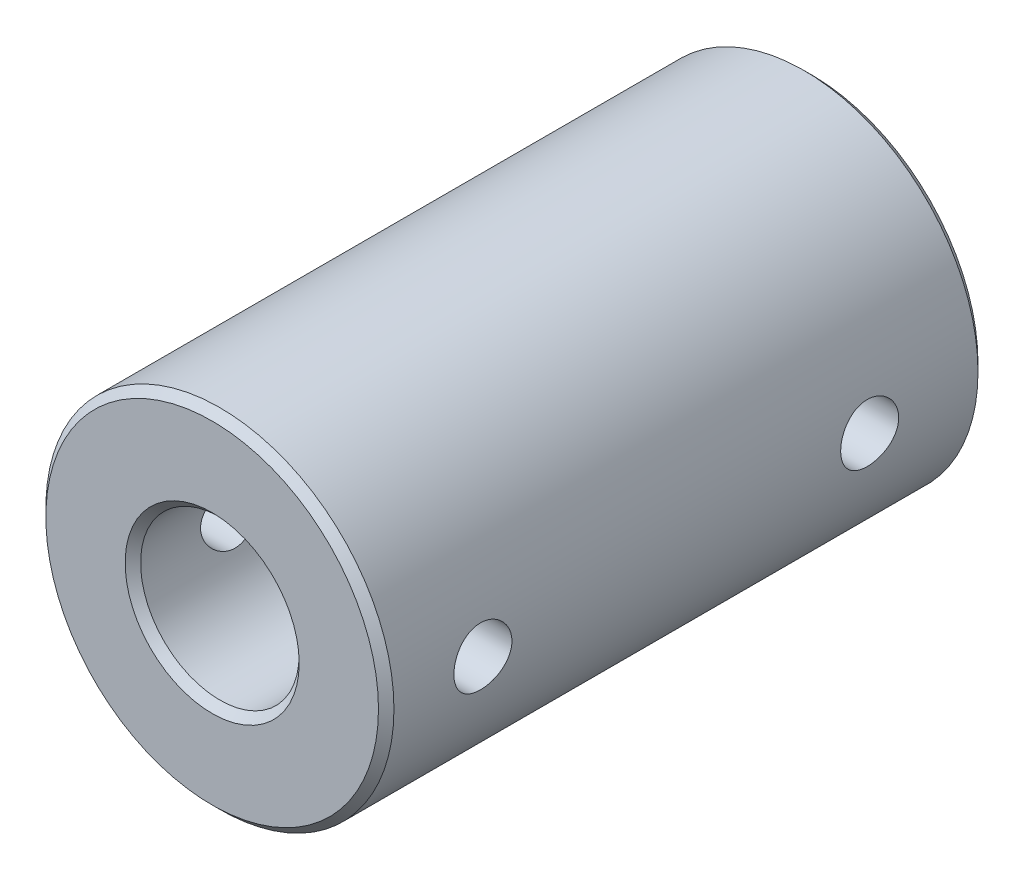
ISO-10303-21;
HEADER;
FILE_DESCRIPTION(('STEP AP214'),'2;1');
FILE_NAME('part.step','',(''),(''),'','','');
FILE_SCHEMA(('AUTOMOTIVE_DESIGN { 1 0 10303 214 1 1 1 1 }'));
ENDSEC;
DATA;
#1=APPLICATION_CONTEXT('core data for automotive mechanical design processes');
#2=APPLICATION_PROTOCOL_DEFINITION('international standard','automotive_design',2000,#1);
#3=PRODUCT_CONTEXT('',#1,'mechanical');
#4=PRODUCT('Part','Part','',(#3));
#5=PRODUCT_RELATED_PRODUCT_CATEGORY('part','',(#4));
#6=PRODUCT_DEFINITION_FORMATION('','',#4);
#7=PRODUCT_DEFINITION_CONTEXT('part definition',#1,'design');
#8=PRODUCT_DEFINITION('design','',#6,#7);
#9=PRODUCT_DEFINITION_SHAPE('','',#8);
#10=(LENGTH_UNIT() NAMED_UNIT(*) SI_UNIT(.MILLI.,.METRE.));
#11=(NAMED_UNIT(*) PLANE_ANGLE_UNIT() SI_UNIT($,.RADIAN.));
#12=(NAMED_UNIT(*) SI_UNIT($,.STERADIAN.) SOLID_ANGLE_UNIT());
#13=UNCERTAINTY_MEASURE_WITH_UNIT(LENGTH_MEASURE(1.E-05),#10,'distance_accuracy_value','');
#14=(GEOMETRIC_REPRESENTATION_CONTEXT(3) GLOBAL_UNCERTAINTY_ASSIGNED_CONTEXT((#13)) GLOBAL_UNIT_ASSIGNED_CONTEXT((#10,
#11,#12)) REPRESENTATION_CONTEXT('',''));
#15=CARTESIAN_POINT('',(0.,0.,0.));
#16=DIRECTION('',(0.,0.,1.));
#17=DIRECTION('',(1.,0.,0.));
#18=AXIS2_PLACEMENT_3D('',#15,#16,#17);
#19=CARTESIAN_POINT('',(0.,0.,15.5));
#20=DIRECTION('',(0.,0.,1.));
#21=DIRECTION('',(1.,0.,0.));
#22=AXIS2_PLACEMENT_3D('',#19,#20,#21);
#23=PLANE('',#22);
#24=CARTESIAN_POINT('',(0.,0.,15.5));
#25=DIRECTION('',(0.,0.,1.));
#26=DIRECTION('',(1.,0.,0.));
#27=AXIS2_PLACEMENT_3D('',#24,#25,#26);
#28=CIRCLE('',#27,2.25);
#29=CARTESIAN_POINT('',(2.25,0.,15.5));
#30=VERTEX_POINT('',#29);
#31=EDGE_CURVE('E129',#30,#30,#28,.F.);
#32=ORIENTED_EDGE('',*,*,#31,.T.);
#33=EDGE_LOOP('',(#32));
#34=FACE_BOUND('',#33,.T.);
#35=CARTESIAN_POINT('',(0.,0.,15.5));
#36=DIRECTION('',(0.,0.,1.));
#37=DIRECTION('',(1.,0.,0.));
#38=AXIS2_PLACEMENT_3D('',#35,#36,#37);
#39=CIRCLE('',#38,4.3);
#40=CARTESIAN_POINT('',(4.3,0.,15.5));
#41=VERTEX_POINT('',#40);
#42=EDGE_CURVE('E126',#41,#41,#39,.T.);
#43=ORIENTED_EDGE('',*,*,#42,.T.);
#44=EDGE_LOOP('',(#43));
#45=FACE_BOUND('',#44,.T.);
#46=ADVANCED_FACE('F40',(#34,#45),#23,.T.);
#47=CARTESIAN_POINT('',(0.,0.,0.));
#48=DIRECTION('',(0.,0.,1.));
#49=DIRECTION('',(1.,0.,0.));
#50=AXIS2_PLACEMENT_3D('',#47,#48,#49);
#51=PLANE('',#50);
#52=CARTESIAN_POINT('',(0.,0.,0.));
#53=DIRECTION('',(0.,0.,1.));
#54=DIRECTION('',(1.,0.,0.));
#55=AXIS2_PLACEMENT_3D('',#52,#53,#54);
#56=CIRCLE('',#55,2.25);
#57=CARTESIAN_POINT('',(2.25,0.,0.));
#58=VERTEX_POINT('',#57);
#59=EDGE_CURVE('E75',#58,#58,#56,.T.);
#60=ORIENTED_EDGE('',*,*,#59,.T.);
#61=EDGE_LOOP('',(#60));
#62=FACE_BOUND('',#61,.T.);
#63=CARTESIAN_POINT('',(0.,0.,0.));
#64=DIRECTION('',(0.,0.,1.));
#65=DIRECTION('',(1.,0.,0.));
#66=AXIS2_PLACEMENT_3D('',#63,#64,#65);
#67=CIRCLE('',#66,4.3);
#68=CARTESIAN_POINT('',(4.3,0.,0.));
#69=VERTEX_POINT('',#68);
#70=EDGE_CURVE('E132',#69,#69,#67,.F.);
#71=ORIENTED_EDGE('',*,*,#70,.T.);
#72=EDGE_LOOP('',(#71));
#73=FACE_BOUND('',#72,.T.);
#74=ADVANCED_FACE('F137',(#62,#73),#51,.F.);
#75=CARTESIAN_POINT('',(0.,0.,15.5));
#76=DIRECTION('',(0.,0.,-1.));
#77=DIRECTION('',(-1.,0.,0.));
#78=AXIS2_PLACEMENT_3D('',#75,#76,#77);
#79=CYLINDRICAL_SURFACE('',#78,4.5);
#80=CARTESIAN_POINT('',(-4.5,0.,3.94999998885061));
#81=CARTESIAN_POINT('',(-4.50000229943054,0.0171804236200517,3.95001026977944));
#82=CARTESIAN_POINT('',(-4.49988852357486,0.034360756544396,3.94959254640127));
#83=CARTESIAN_POINT('',(-4.49944089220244,0.0685497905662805,3.94791326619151));
#84=CARTESIAN_POINT('',(-4.49910867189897,0.0855588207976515,3.94665797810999));
#85=CARTESIAN_POINT('',(-4.49823874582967,0.119380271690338,3.94332642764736));
#86=CARTESIAN_POINT('',(-4.49770237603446,0.13619325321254,3.94125549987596));
#87=CARTESIAN_POINT('',(-4.49643907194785,0.169597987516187,3.93631644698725));
#88=CARTESIAN_POINT('',(-4.49571322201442,0.186190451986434,3.93345285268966));
#89=CARTESIAN_POINT('',(-4.49408572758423,0.219129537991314,3.9269518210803));
#90=CARTESIAN_POINT('',(-4.49318496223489,0.235476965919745,3.92331824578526));
#91=CARTESIAN_POINT('',(-4.49122238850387,0.267901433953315,3.91530054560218));
#92=CARTESIAN_POINT('',(-4.49016129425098,0.283979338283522,3.91091973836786));
#93=CARTESIAN_POINT('',(-4.48789276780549,0.315840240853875,3.90143072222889));
#94=CARTESIAN_POINT('',(-4.48668591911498,0.331624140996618,3.89632540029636));
#95=CARTESIAN_POINT('',(-4.48414055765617,0.362872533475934,3.88541039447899));
#96=CARTESIAN_POINT('',(-4.48280252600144,0.37833795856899,3.87960326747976));
#97=CARTESIAN_POINT('',(-4.48000944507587,0.4089249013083,3.8673075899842));
#98=CARTESIAN_POINT('',(-4.47855479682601,0.424047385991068,3.86082135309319));
#99=CARTESIAN_POINT('',(-4.47554310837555,0.453923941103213,3.84719030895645));
#100=CARTESIAN_POINT('',(-4.47398640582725,0.468679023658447,3.84004764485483));
#101=CARTESIAN_POINT('',(-4.47078521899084,0.497796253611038,3.82512652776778));
#102=CARTESIAN_POINT('',(-4.46914102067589,0.512159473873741,3.81735010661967));
#103=CARTESIAN_POINT('',(-4.46577944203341,0.540468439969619,3.8011841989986));
#104=CARTESIAN_POINT('',(-4.46406230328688,0.554415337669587,3.79279667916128));
#105=CARTESIAN_POINT('',(-4.46056943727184,0.581867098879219,3.77543125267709));
#106=CARTESIAN_POINT('',(-4.45879391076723,0.595373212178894,3.76645528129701));
#107=CARTESIAN_POINT('',(-4.45519886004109,0.621918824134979,3.7479355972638));
#108=CARTESIAN_POINT('',(-4.45337949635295,0.634959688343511,3.73839381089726));
#109=CARTESIAN_POINT('',(-4.4497113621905,0.660550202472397,3.71876512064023));
#110=CARTESIAN_POINT('',(-4.44786271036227,0.673101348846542,3.70868014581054));
#111=CARTESIAN_POINT('',(-4.44415059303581,0.697687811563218,3.68798769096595));
#112=CARTESIAN_POINT('',(-4.44228720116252,0.709724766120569,3.67738214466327));
#113=CARTESIAN_POINT('',(-4.43856020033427,0.733258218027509,3.65567115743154));
#114=CARTESIAN_POINT('',(-4.43669661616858,0.74475650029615,3.64456764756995));
#115=CARTESIAN_POINT('',(-4.432983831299,0.767187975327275,3.62188335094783));
#116=CARTESIAN_POINT('',(-4.43113460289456,0.778123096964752,3.61030447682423));
#117=CARTESIAN_POINT('',(-4.42746513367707,0.799403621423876,3.58669208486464));
#118=CARTESIAN_POINT('',(-4.42564481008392,0.809751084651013,3.57466043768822));
#119=CARTESIAN_POINT('',(-4.42204775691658,0.829831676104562,3.55016515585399));
#120=CARTESIAN_POINT('',(-4.42027088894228,0.839566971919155,3.53770331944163));
#121=CARTESIAN_POINT('',(-4.41677535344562,0.858398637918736,3.5123703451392));
#122=CARTESIAN_POINT('',(-4.41505649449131,0.867497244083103,3.49950089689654));
#123=CARTESIAN_POINT('',(-4.41169158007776,0.885030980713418,3.47337542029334));
#124=CARTESIAN_POINT('',(-4.41004528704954,0.893468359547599,3.46012093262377));
#125=CARTESIAN_POINT('',(-4.40684009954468,0.909655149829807,3.43324813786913));
#126=CARTESIAN_POINT('',(-4.40528093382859,0.917406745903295,3.41963118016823));
#127=CARTESIAN_POINT('',(-4.40226458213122,0.932197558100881,3.39205624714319));
#128=CARTESIAN_POINT('',(-4.40080711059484,0.939238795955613,3.37809938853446));
#129=CARTESIAN_POINT('',(-4.39800870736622,0.952584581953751,3.34986749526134));
#130=CARTESIAN_POINT('',(-4.39666750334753,0.958890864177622,3.33559330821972));
#131=CARTESIAN_POINT('',(-4.39411616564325,0.97074255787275,3.30674963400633));
#132=CARTESIAN_POINT('',(-4.39290580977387,0.976289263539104,3.2921806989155));
#133=CARTESIAN_POINT('',(-4.39063065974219,0.986597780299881,3.26277042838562));
#134=CARTESIAN_POINT('',(-4.38956574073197,0.991360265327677,3.24792933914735));
#135=CARTESIAN_POINT('',(-4.38759590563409,1.00007649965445,3.21799766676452));
#136=CARTESIAN_POINT('',(-4.38669101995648,1.00403009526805,3.20290703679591));
#137=CARTESIAN_POINT('',(-4.38505563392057,1.01110492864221,3.172499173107));
#138=CARTESIAN_POINT('',(-4.38432538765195,1.01422495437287,3.15718164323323));
#139=CARTESIAN_POINT('',(-4.38305358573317,1.01960922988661,3.1263428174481));
#140=CARTESIAN_POINT('',(-4.38251258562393,1.02187096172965,3.11082105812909));
#141=CARTESIAN_POINT('',(-4.38163352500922,1.02551558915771,3.07959653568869));
#142=CARTESIAN_POINT('',(-4.38129640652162,1.02689440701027,3.06389326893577));
#143=CARTESIAN_POINT('',(-4.38083918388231,1.02874998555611,3.03232831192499));
#144=CARTESIAN_POINT('',(-4.38072049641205,1.0292208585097,3.01646625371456));
#145=CARTESIAN_POINT('',(-4.38071447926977,1.02923904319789,2.98474163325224));
#146=CARTESIAN_POINT('',(-4.38082714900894,1.02878635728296,2.96887907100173));
#147=CARTESIAN_POINT('',(-4.38127293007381,1.02696923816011,2.93731201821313));
#148=CARTESIAN_POINT('',(-4.38160461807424,1.02561069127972,2.92160716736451));
#149=CARTESIAN_POINT('',(-4.38247325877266,1.02200782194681,2.89037843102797));
#150=CARTESIAN_POINT('',(-4.38300926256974,1.0197675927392,2.87485404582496));
#151=CARTESIAN_POINT('',(-4.38427154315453,1.01442749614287,2.84400895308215));
#152=CARTESIAN_POINT('',(-4.38499725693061,1.01133017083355,2.82868778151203));
#153=CARTESIAN_POINT('',(-4.38662403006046,1.00430165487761,2.7982716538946));
#154=CARTESIAN_POINT('',(-4.38752482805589,1.000371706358,2.7831763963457));
#155=CARTESIAN_POINT('',(-4.38948693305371,0.991703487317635,2.75323452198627));
#156=CARTESIAN_POINT('',(-4.3905482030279,0.986965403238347,2.7383878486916));
#157=CARTESIAN_POINT('',(-4.39281648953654,0.976706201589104,2.70896549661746));
#158=CARTESIAN_POINT('',(-4.3940236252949,0.971184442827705,2.69439005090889));
#159=CARTESIAN_POINT('',(-4.39656894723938,0.959382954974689,2.66553247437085));
#160=CARTESIAN_POINT('',(-4.3979073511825,0.953101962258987,2.65125088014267));
#161=CARTESIAN_POINT('',(-4.40070056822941,0.939806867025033,2.62300332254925));
#162=CARTESIAN_POINT('',(-4.40215565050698,0.932791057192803,2.60903819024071));
#163=CARTESIAN_POINT('',(-4.40516762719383,0.918051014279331,2.58144588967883));
#164=CARTESIAN_POINT('',(-4.4067248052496,0.91032478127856,2.56781982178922));
#165=CARTESIAN_POINT('',(-4.40992641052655,0.894188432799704,2.54092801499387));
#166=CARTESIAN_POINT('',(-4.41157110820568,0.885776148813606,2.52766361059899));
#167=CARTESIAN_POINT('',(-4.41493321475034,0.868292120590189,2.50151753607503));
#168=CARTESIAN_POINT('',(-4.41665086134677,0.859218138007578,2.48863739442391));
#169=CARTESIAN_POINT('',(-4.42014434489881,0.840435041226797,2.46328229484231));
#170=CARTESIAN_POINT('',(-4.42192037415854,0.830723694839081,2.45080901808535));
#171=CARTESIAN_POINT('',(-4.42551611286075,0.810690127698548,2.42629014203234));
#172=CARTESIAN_POINT('',(-4.42733596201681,0.800365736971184,2.41424633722));
#173=CARTESIAN_POINT('',(-4.43100483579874,0.779130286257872,2.39060894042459));
#174=CARTESIAN_POINT('',(-4.43285394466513,0.768217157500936,2.37901722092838));
#175=CARTESIAN_POINT('',(-4.43656683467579,0.745828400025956,2.35630656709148));
#176=CARTESIAN_POINT('',(-4.43843064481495,0.73435082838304,2.34518955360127));
#177=CARTESIAN_POINT('',(-4.44215843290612,0.710857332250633,2.32345091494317));
#178=CARTESIAN_POINT('',(-4.4440223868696,0.698839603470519,2.31283123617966));
#179=CARTESIAN_POINT('',(-4.44773595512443,0.674289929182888,2.29210989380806));
#180=CARTESIAN_POINT('',(-4.44958549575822,0.661756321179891,2.28201018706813));
#181=CARTESIAN_POINT('',(-4.4532557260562,0.636199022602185,2.26235143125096));
#182=CARTESIAN_POINT('',(-4.45507629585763,0.623173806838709,2.25279434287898));
#183=CARTESIAN_POINT('',(-4.45867406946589,0.596657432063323,2.23424347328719));
#184=CARTESIAN_POINT('',(-4.46045110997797,0.583164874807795,2.2252516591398));
#185=CARTESIAN_POINT('',(-4.46394730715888,0.55573796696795,2.20785398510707));
#186=CARTESIAN_POINT('',(-4.46566625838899,0.541802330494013,2.1994501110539));
#187=CARTESIAN_POINT('',(-4.46903175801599,0.51351342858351,2.18325095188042));
#188=CARTESIAN_POINT('',(-4.47067805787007,0.499158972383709,2.17545769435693));
#189=CARTESIAN_POINT('',(-4.47388373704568,0.470056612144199,2.16050237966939));
#190=CARTESIAN_POINT('',(-4.47544282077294,0.455307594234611,2.15334242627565));
#191=CARTESIAN_POINT('',(-4.47845955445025,0.425440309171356,2.13967629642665));
#192=CARTESIAN_POINT('',(-4.47991685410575,0.410320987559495,2.13317234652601));
#193=CARTESIAN_POINT('',(-4.48271551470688,0.379737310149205,2.1208407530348));
#194=CARTESIAN_POINT('',(-4.48405645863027,0.364271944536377,2.11501551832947));
#195=CARTESIAN_POINT('',(-4.48660791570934,0.333020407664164,2.104063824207));
#196=CARTESIAN_POINT('',(-4.48781792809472,0.317233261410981,2.09894002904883));
#197=CARTESIAN_POINT('',(-4.49009304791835,0.285362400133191,2.08941360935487));
#198=CARTESIAN_POINT('',(-4.49115754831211,0.26927774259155,2.08501399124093));
#199=CARTESIAN_POINT('',(-4.49312719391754,0.236836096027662,2.07695823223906));
#200=CARTESIAN_POINT('',(-4.49403159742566,0.22047820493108,2.07330554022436));
#201=CARTESIAN_POINT('',(-4.49566662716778,0.187514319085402,2.0667658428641));
#202=CARTESIAN_POINT('',(-4.49639634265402,0.170907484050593,2.06388284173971));
#203=CARTESIAN_POINT('',(-4.49766761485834,0.137469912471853,2.05890460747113));
#204=CARTESIAN_POINT('',(-4.49820805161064,0.120638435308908,2.05681405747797));
#205=CARTESIAN_POINT('',(-4.49908640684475,0.0867757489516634,2.0534427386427));
#206=CARTESIAN_POINT('',(-4.49942295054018,0.0697439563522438,2.05216746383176));
#207=CARTESIAN_POINT('',(-4.49987927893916,0.0355047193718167,2.05044836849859));
#208=CARTESIAN_POINT('',(-4.49999738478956,0.0182969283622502,2.05001098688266));
#209=CARTESIAN_POINT('',(-4.50000235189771,-0.0161202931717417,2.04999009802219));
#210=CARTESIAN_POINT('',(-4.49988919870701,-0.0333297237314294,2.05040664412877));
#211=CARTESIAN_POINT('',(-4.49944231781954,-0.0675753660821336,2.05208540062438));
#212=CARTESIAN_POINT('',(-4.49911024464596,-0.0846119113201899,2.05334126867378));
#213=CARTESIAN_POINT('',(-4.49824049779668,-0.118487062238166,2.05667473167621));
#214=CARTESIAN_POINT('',(-4.49770417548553,-0.135326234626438,2.05874692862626));
#215=CARTESIAN_POINT('',(-4.49644077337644,-0.168781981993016,2.06368947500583));
#216=CARTESIAN_POINT('',(-4.49571479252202,-0.185399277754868,2.06655523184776));
#217=CARTESIAN_POINT('',(-4.49408688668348,-0.218386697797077,2.07306140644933));
#218=CARTESIAN_POINT('',(-4.49318585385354,-0.23475763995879,2.07669790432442));
#219=CARTESIAN_POINT('',(-4.49122260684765,-0.267227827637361,2.08472222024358));
#220=CARTESIAN_POINT('',(-4.49016111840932,-0.283327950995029,2.08910666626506));
#221=CARTESIAN_POINT('',(-4.48789168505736,-0.315232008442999,2.09860365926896));
#222=CARTESIAN_POINT('',(-4.48668433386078,-0.331036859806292,2.10371326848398));
#223=CARTESIAN_POINT('',(-4.48413786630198,-0.362325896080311,2.11463748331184));
#224=CARTESIAN_POINT('',(-4.48279923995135,-0.377811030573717,2.12044948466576));
#225=CARTESIAN_POINT('',(-4.48000488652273,-0.408436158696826,2.13275547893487));
#226=CARTESIAN_POINT('',(-4.47854956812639,-0.423577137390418,2.13924711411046));
#227=CARTESIAN_POINT('',(-4.47553647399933,-0.453489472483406,2.15288945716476));
#228=CARTESIAN_POINT('',(-4.47397904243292,-0.468261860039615,2.16003798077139));
#229=CARTESIAN_POINT('',(-4.47077634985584,-0.497412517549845,2.17497125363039));
#230=CARTESIAN_POINT('',(-4.46913138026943,-0.511791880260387,2.18275393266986));
#231=CARTESIAN_POINT('',(-4.46576822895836,-0.540131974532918,2.19893272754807));
#232=CARTESIAN_POINT('',(-4.46405029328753,-0.554093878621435,2.20732684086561));
#233=CARTESIAN_POINT('',(-4.46055582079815,-0.581574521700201,2.22470576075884));
#234=CARTESIAN_POINT('',(-4.45877948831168,-0.595094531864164,2.2336885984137));
#235=CARTESIAN_POINT('',(-4.45518283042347,-0.621666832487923,2.2522222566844));
#236=CARTESIAN_POINT('',(-4.45336266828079,-0.634720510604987,2.26177111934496));
#237=CARTESIAN_POINT('',(-4.44969295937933,-0.660335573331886,2.28141413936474));
#238=CARTESIAN_POINT('',(-4.44784353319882,-0.672898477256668,2.29150633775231));
#239=CARTESIAN_POINT('',(-4.44412990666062,-0.697507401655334,2.31221335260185));
#240=CARTESIAN_POINT('',(-4.44226578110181,-0.709555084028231,2.3228262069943));
#241=CARTESIAN_POINT('',(-4.43853736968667,-0.733108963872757,2.34455185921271));
#242=CARTESIAN_POINT('',(-4.43667310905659,-0.744616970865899,2.35566269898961));
#243=CARTESIAN_POINT('',(-4.43295904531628,-0.767066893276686,2.37836164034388));
#244=CARTESIAN_POINT('',(-4.4311092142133,-0.77801076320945,2.38994780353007));
#245=CARTESIAN_POINT('',(-4.42743863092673,-0.799307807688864,2.41357469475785));
#246=CARTESIAN_POINT('',(-4.42561779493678,-0.809663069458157,2.42561352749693));
#247=CARTESIAN_POINT('',(-4.42201982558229,-0.82975830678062,2.45012303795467));
#248=CARTESIAN_POINT('',(-4.42024255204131,-0.83950047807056,2.46259189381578));
#249=CARTESIAN_POINT('',(-4.41674633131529,-0.858344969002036,2.48793870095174));
#250=CARTESIAN_POINT('',(-4.41502719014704,-0.867449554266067,2.50081493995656));
#251=CARTESIAN_POINT('',(-4.41166185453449,-0.884994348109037,2.52695372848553));
#252=CARTESIAN_POINT('',(-4.41001541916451,-0.89343683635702,2.54021471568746));
#253=CARTESIAN_POINT('',(-4.40681010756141,-0.909632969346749,2.56710017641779));
#254=CARTESIAN_POINT('',(-4.40525095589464,-0.917388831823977,2.58072327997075));
#255=CARTESIAN_POINT('',(-4.40223481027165,-0.932187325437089,2.60831010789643));
#256=CARTESIAN_POINT('',(-4.40077752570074,-0.939232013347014,2.62227269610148));
#257=CARTESIAN_POINT('',(-4.39797969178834,-0.952583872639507,2.65051558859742));
#258=CARTESIAN_POINT('',(-4.39663886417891,-0.958892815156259,2.66479502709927));
#259=CARTESIAN_POINT('',(-4.39408849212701,-0.970749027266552,2.69364867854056));
#260=CARTESIAN_POINT('',(-4.39287871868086,-0.976297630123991,2.7082223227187));
#261=CARTESIAN_POINT('',(-4.39060496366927,-0.98660916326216,2.73764142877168));
#262=CARTESIAN_POINT('',(-4.38954084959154,-0.991372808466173,2.75248662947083));
#263=CARTESIAN_POINT('',(-4.38757287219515,-1.00009061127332,2.78242585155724));
#264=CARTESIAN_POINT('',(-4.38666903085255,-1.00404465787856,2.79751990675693));
#265=CARTESIAN_POINT('',(-4.38503599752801,-1.01111966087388,2.82793398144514));
#266=CARTESIAN_POINT('',(-4.3843070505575,-1.01423944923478,2.84325428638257));
#267=CARTESIAN_POINT('',(-4.38303813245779,-1.01962256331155,2.87409759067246));
#268=CARTESIAN_POINT('',(-4.38249870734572,-1.02188341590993,2.88962104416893));
#269=CARTESIAN_POINT('',(-4.38162308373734,-1.02552554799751,2.92084919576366));
#270=CARTESIAN_POINT('',(-4.38128781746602,-1.02690279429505,2.93655439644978));
#271=CARTESIAN_POINT('',(-4.38094850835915,-1.0282895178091,2.96018832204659));
#272=CARTESIAN_POINT('',(-4.38086266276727,-1.02863858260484,2.96809739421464));
#273=CARTESIAN_POINT('',(-4.38074721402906,-1.02910774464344,2.98395228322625));
#274=CARTESIAN_POINT('',(-4.3807178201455,-1.02922698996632,2.99189812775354));
#275=CARTESIAN_POINT('',(-4.38071706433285,-1.02923329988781,3.00778974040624));
#276=CARTESIAN_POINT('',(-4.38074570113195,-1.02912036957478,3.01573550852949));
#277=CARTESIAN_POINT('',(-4.38085960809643,-1.02866342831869,3.03159009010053));
#278=CARTESIAN_POINT('',(-4.3809446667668,-1.02832028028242,3.0394989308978));
#279=CARTESIAN_POINT('',(-4.38128158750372,-1.02695085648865,3.06313152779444));
#280=CARTESIAN_POINT('',(-4.38161521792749,-1.02558460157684,3.07883586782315));
#281=CARTESIAN_POINT('',(-4.38248752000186,-1.02196326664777,3.11006179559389));
#282=CARTESIAN_POINT('',(-4.38302524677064,-1.01971228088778,3.12558389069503));
#283=CARTESIAN_POINT('',(-4.3842907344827,-1.01434786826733,3.15642405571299));
#284=CARTESIAN_POINT('',(-4.38501794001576,-1.01123696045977,3.17174258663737));
#285=CARTESIAN_POINT('',(-4.38664747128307,-1.00417881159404,3.20215276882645));
#286=CARTESIAN_POINT('',(-4.38754954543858,-1.00023277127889,3.21724471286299));
#287=CARTESIAN_POINT('',(-4.38951398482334,-0.991530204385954,3.24717944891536));
#288=CARTESIAN_POINT('',(-4.39057632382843,-0.986773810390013,3.26202228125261));
#289=CARTESIAN_POINT('',(-4.39284654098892,-0.976476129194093,3.29143646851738));
#290=CARTESIAN_POINT('',(-4.39405454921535,-0.970934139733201,3.30600756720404));
#291=CARTESIAN_POINT('',(-4.39660141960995,-0.959090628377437,3.33485602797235));
#292=CARTESIAN_POINT('',(-4.39794050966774,-0.952787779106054,3.34913282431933));
#293=CARTESIAN_POINT('',(-4.40073491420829,-0.939447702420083,3.3773704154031));
#294=CARTESIAN_POINT('',(-4.40219050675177,-0.932408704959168,3.39133034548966));
#295=CARTESIAN_POINT('',(-4.40520333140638,-0.91762130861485,3.4189119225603));
#296=CARTESIAN_POINT('',(-4.40676085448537,-0.909870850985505,3.43253243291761));
#297=CARTESIAN_POINT('',(-4.40996298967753,-0.893685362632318,3.4594128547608));
#298=CARTESIAN_POINT('',(-4.41160787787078,-0.885248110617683,3.47267139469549));
#299=CARTESIAN_POINT('',(-4.41497021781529,-0.867713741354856,3.49880551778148));
#300=CARTESIAN_POINT('',(-4.41668791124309,-0.858614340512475,3.51167953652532));
#301=CARTESIAN_POINT('',(-4.42018135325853,-0.839780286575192,3.53702221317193));
#302=CARTESIAN_POINT('',(-4.42195729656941,-0.830043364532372,3.54948915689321));
#303=CARTESIAN_POINT('',(-4.42555274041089,-0.809958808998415,3.5739952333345));
#304=CARTESIAN_POINT('',(-4.42737238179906,-0.799608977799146,3.58603254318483));
#305=CARTESIAN_POINT('',(-4.43104072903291,-0.778323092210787,3.6096568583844));
#306=CARTESIAN_POINT('',(-4.43288951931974,-0.767384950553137,3.6212419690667));
#307=CARTESIAN_POINT('',(-4.43660167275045,-0.744946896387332,3.64393935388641));
#308=CARTESIAN_POINT('',(-4.43846506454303,-0.733445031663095,3.65504969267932));
#309=CARTESIAN_POINT('',(-4.44219192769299,-0.709903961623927,3.67677496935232));
#310=CARTESIAN_POINT('',(-4.4440553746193,-0.697862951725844,3.68738795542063));
#311=CARTESIAN_POINT('',(-4.4477678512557,-0.673268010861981,3.70809593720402));
#312=CARTESIAN_POINT('',(-4.44961680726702,-0.660712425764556,3.71818898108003));
#313=CARTESIAN_POINT('',(-4.45328580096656,-0.635112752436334,3.73783447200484));
#314=CARTESIAN_POINT('',(-4.45510571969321,-0.622067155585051,3.74738497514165));
#315=CARTESIAN_POINT('',(-4.45870213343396,-0.595511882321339,3.76592276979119));
#316=CARTESIAN_POINT('',(-4.46047846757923,-0.582000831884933,3.77490812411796));
#317=CARTESIAN_POINT('',(-4.4639732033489,-0.554539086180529,3.79229300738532));
#318=CARTESIAN_POINT('',(-4.46569140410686,-0.5405871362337,3.80069059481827));
#319=CARTESIAN_POINT('',(-4.4690553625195,-0.512268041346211,3.81687734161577));
#320=CARTESIAN_POINT('',(-4.47070087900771,-0.497899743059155,3.82466453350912));
#321=CARTESIAN_POINT('',(-4.47390495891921,-0.468772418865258,3.83960790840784));
#322=CARTESIAN_POINT('',(-4.47546323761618,-0.454012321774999,3.84676206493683));
#323=CARTESIAN_POINT('',(-4.47847833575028,-0.42412588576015,3.86041682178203));
#324=CARTESIAN_POINT('',(-4.47993481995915,-0.408998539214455,3.86691529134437));
#325=CARTESIAN_POINT('',(-4.4827318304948,-0.378402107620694,3.87923617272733));
#326=CARTESIAN_POINT('',(-4.48407195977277,-0.362932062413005,3.88505629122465));
#327=CARTESIAN_POINT('',(-4.48662177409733,-0.331674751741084,3.89599802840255));
#328=CARTESIAN_POINT('',(-4.48783098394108,-0.315886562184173,3.90111711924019));
#329=CARTESIAN_POINT('',(-4.49010448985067,-0.284017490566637,3.91063443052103));
#330=CARTESIAN_POINT('',(-4.49116821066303,-0.267935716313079,3.91502980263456));
#331=CARTESIAN_POINT('',(-4.49313629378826,-0.235504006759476,3.92307739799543));
#332=CARTESIAN_POINT('',(-4.49403995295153,-0.219153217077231,3.92672635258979));
#333=CARTESIAN_POINT('',(-4.4956734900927,-0.186207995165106,3.93325891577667));
#334=CARTESIAN_POINT('',(-4.49640250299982,-0.169612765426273,3.93613872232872));
#335=CARTESIAN_POINT('',(-4.49767238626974,-0.136203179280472,3.94111097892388));
#336=CARTESIAN_POINT('',(-4.49821218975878,-0.119388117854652,3.94319896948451));
#337=CARTESIAN_POINT('',(-4.49908923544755,-0.0855632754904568,3.94656543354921));
#338=CARTESIAN_POINT('',(-4.49942516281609,-0.0685529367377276,3.94783865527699));
#339=CARTESIAN_POINT('',(-4.49988045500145,-0.0343621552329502,3.94955458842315));
#340=CARTESIAN_POINT('',(-4.49999820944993,-0.017181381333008,3.94999112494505));
#341=CARTESIAN_POINT('',(-4.5,0.,3.94999998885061));
#342=B_SPLINE_CURVE_WITH_KNOTS('',3,(#80,#81,#82,#83,#84,#85,#86,#87,#88,#89,#90,#91,#92,#93,
#94,#95,#96,#97,#98,#99,#100,#101,#102,#103,#104,#105,#106,#107,#108,#109,#110,#111,#112,#113,
#114,#115,#116,#117,#118,#119,#120,#121,#122,#123,#124,#125,#126,#127,#128,#129,#130,#131,#132,
#133,#134,#135,#136,#137,#138,#139,#140,#141,#142,#143,#144,#145,#146,#147,#148,#149,#150,#151,
#152,#153,#154,#155,#156,#157,#158,#159,#160,#161,#162,#163,#164,#165,#166,#167,#168,#169,#170,
#171,#172,#173,#174,#175,#176,#177,#178,#179,#180,#181,#182,#183,#184,#185,#186,#187,#188,#189,
#190,#191,#192,#193,#194,#195,#196,#197,#198,#199,#200,#201,#202,#203,#204,#205,#206,#207,#208,
#209,#210,#211,#212,#213,#214,#215,#216,#217,#218,#219,#220,#221,#222,#223,#224,#225,#226,#227,
#228,#229,#230,#231,#232,#233,#234,#235,#236,#237,#238,#239,#240,#241,#242,#243,#244,#245,#246,
#247,#248,#249,#250,#251,#252,#253,#254,#255,#256,#257,#258,#259,#260,#261,#262,#263,#264,#265,
#266,#267,#268,#269,#270,#271,#272,#273,#274,#275,#276,#277,#278,#279,#280,#281,#282,#283,#284,
#285,#286,#287,#288,#289,#290,#291,#292,#293,#294,#295,#296,#297,#298,#299,#300,#301,#302,#303,
#304,#305,#306,#307,#308,#309,#310,#311,#312,#313,#314,#315,#316,#317,#318,#319,#320,#321,#322,
#323,#324,#325,#326,#327,#328,#329,#330,#331,#332,#333,#334,#335,#336,#337,#338,#339,#340,#341),
.UNSPECIFIED.,.F.,.F.,(4,2,2,2,2,2,2,2,2,2,2,2,2,2,2,2,2,2,2,2,2,2,2,2,2,2,2,2,2,2,2,2,2,2,2,2,
2,2,2,2,2,2,2,2,2,2,2,2,2,2,2,2,2,2,2,2,2,2,2,2,2,2,2,2,2,2,2,2,2,2,2,2,2,2,2,2,2,2,2,2,2,2,2,2,
2,2,2,2,2,2,2,2,2,2,2,2,2,2,2,2,2,2,2,2,2,2,2,2,2,2,2,2,2,2,2,2,2,2,2,2,2,2,2,2,2,2,2,2,2,2,4),
(0.,0.0515350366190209,0.102688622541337,0.153513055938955,0.204052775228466,0.254344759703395,
0.304419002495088,0.354299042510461,0.404002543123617,0.453541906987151,0.50292491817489,
0.552155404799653,0.601233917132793,0.650158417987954,0.69892498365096,0.747528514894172,
0.795963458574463,0.84422454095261,0.892307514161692,0.940209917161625,0.987931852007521,
1.03547677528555,1.08285230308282,1.13007102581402,1.17715132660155,1.22411819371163,
1.27100401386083,1.3178493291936,1.36470353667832,1.41162550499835,1.45868408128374,
1.5059584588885,1.55353837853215,1.60111817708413,1.64839177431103,1.69544844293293,
1.74236701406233,1.78921607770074,1.83605434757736,1.8829311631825,1.92988710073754,
1.97695466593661,2.02415904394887,2.07151888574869,2.11904711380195,2.16675173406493,
2.21463664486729,2.26270243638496,2.31094717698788,2.3593671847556,2.40795778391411,
2.45671404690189,2.50563152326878,2.55470695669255,2.60393899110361,2.65332886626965,
2.70288110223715,2.75260417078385,2.80251115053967,2.852620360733,2.90295596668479,
2.95354854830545,3.00443562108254,3.05566209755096,3.10728067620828,3.15890247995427,
3.21013854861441,3.26104135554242,3.31165551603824,3.36201818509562,3.41215952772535,
3.46210324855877,3.51186716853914,3.56146383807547,3.6109011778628,3.66018314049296,
3.70931038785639,3.75828098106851,3.80709108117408,3.85573566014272,3.90420922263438,
3.9525065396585,4.00062339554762,4.04855734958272,4.09630851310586,4.14388034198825,
4.19128044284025,4.23852138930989,4.28562154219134,4.33260586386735,4.37950671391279,
4.42636460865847,4.47322892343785,4.52015851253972,4.56722221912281,4.61449924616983,
4.63824804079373,4.66208470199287,4.68592084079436,4.7096681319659,4.75693954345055,
4.8039947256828,4.85091349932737,4.8977652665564,4.94460937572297,4.99149562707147,
5.03846489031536,5.08554980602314,5.13277554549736,5.1801606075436,5.22771763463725,
5.27545423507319,5.32337380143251,5.3714763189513,5.41975916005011,5.46821786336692,
5.51684689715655,5.56564040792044,5.61459295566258,5.66370023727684,5.71295979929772,
5.76237174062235,5.81193940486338,5.86167006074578,5.91157556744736,5.96167302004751,
6.01198536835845,6.06254200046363,6.1133792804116,6.16454102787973,6.2160789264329),.UNSPECIFIED.);
#343=CARTESIAN_POINT('',(-4.5,0.,3.94999998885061));
#344=VERTEX_POINT('',#343);
#345=EDGE_CURVE('E55',#344,#344,#342,.F.);
#346=ORIENTED_EDGE('',*,*,#345,.T.);
#347=EDGE_LOOP('',(#346));
#348=FACE_BOUND('',#347,.T.);
#349=CARTESIAN_POINT('',(-4.5,0.,14.0964101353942));
#350=CARTESIAN_POINT('',(-4.50000334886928,0.0191710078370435,14.096423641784));
#351=CARTESIAN_POINT('',(-4.49986185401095,0.0383419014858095,14.0959433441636));
#352=CARTESIAN_POINT('',(-4.49930440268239,0.0764901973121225,14.0940097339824));
#353=CARTESIAN_POINT('',(-4.49889045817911,0.0954679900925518,14.0925635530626));
#354=CARTESIAN_POINT('',(-4.49780632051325,0.133202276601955,14.0887245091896));
#355=CARTESIAN_POINT('',(-4.49713771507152,0.151959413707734,14.086337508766));
#356=CARTESIAN_POINT('',(-4.49556292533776,0.18922507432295,14.0806444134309));
#357=CARTESIAN_POINT('',(-4.49465797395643,0.207734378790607,14.0773430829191));
#358=CARTESIAN_POINT('',(-4.49262894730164,0.24447707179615,14.0698483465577));
#359=CARTESIAN_POINT('',(-4.4915058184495,0.262711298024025,14.0656587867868));
#360=CARTESIAN_POINT('',(-4.48905886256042,0.298876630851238,14.0564145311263));
#361=CARTESIAN_POINT('',(-4.48773575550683,0.316808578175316,14.0513629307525));
#362=CARTESIAN_POINT('',(-4.48490720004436,0.352342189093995,14.0404213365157));
#363=CARTESIAN_POINT('',(-4.48340229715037,0.369944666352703,14.0345338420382));
#364=CARTESIAN_POINT('',(-4.48022845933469,0.404792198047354,14.0219470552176));
#365=CARTESIAN_POINT('',(-4.47855993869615,0.422038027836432,14.0152498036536));
#366=CARTESIAN_POINT('',(-4.47507713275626,0.456145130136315,14.0010699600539));
#367=CARTESIAN_POINT('',(-4.47326316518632,0.473007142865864,13.9935890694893));
#368=CARTESIAN_POINT('',(-4.46950770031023,0.506319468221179,13.9778682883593));
#369=CARTESIAN_POINT('',(-4.46756645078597,0.522770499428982,13.9696298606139));
#370=CARTESIAN_POINT('',(-4.46357463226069,0.555233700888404,13.952420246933));
#371=CARTESIAN_POINT('',(-4.4615242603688,0.571246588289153,13.9434503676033));
#372=CARTESIAN_POINT('',(-4.45733238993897,0.602806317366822,13.9248040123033));
#373=CARTESIAN_POINT('',(-4.45519105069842,0.618353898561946,13.9151287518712));
#374=CARTESIAN_POINT('',(-4.4508354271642,0.6489558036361,13.8950977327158));
#375=CARTESIAN_POINT('',(-4.44862127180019,0.664010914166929,13.8847431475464));
#376=CARTESIAN_POINT('',(-4.44413819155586,0.693600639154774,13.8633795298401));
#377=CARTESIAN_POINT('',(-4.44186936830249,0.708136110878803,13.8523716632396));
#378=CARTESIAN_POINT('',(-4.43729512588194,0.736659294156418,13.8297275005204));
#379=CARTESIAN_POINT('',(-4.43498978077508,0.750647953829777,13.8180923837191));
#380=CARTESIAN_POINT('',(-4.43036066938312,0.778050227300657,13.7942197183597));
#381=CARTESIAN_POINT('',(-4.42803694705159,0.79146489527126,13.7819833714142));
#382=CARTESIAN_POINT('',(-4.42338925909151,0.817691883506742,13.7569342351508));
#383=CARTESIAN_POINT('',(-4.42106530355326,0.830505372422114,13.7441226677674));
#384=CARTESIAN_POINT('',(-4.41643533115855,0.855502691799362,13.7179490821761));
#385=CARTESIAN_POINT('',(-4.41412928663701,0.867687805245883,13.7045882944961));
#386=CARTESIAN_POINT('',(-4.40955332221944,0.891401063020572,13.6773422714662));
#387=CARTESIAN_POINT('',(-4.40728333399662,0.902930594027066,13.6634582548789));
#388=CARTESIAN_POINT('',(-4.40279767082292,0.925305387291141,13.6351917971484));
#389=CARTESIAN_POINT('',(-4.40058188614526,0.936152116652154,13.6208105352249));
#390=CARTESIAN_POINT('',(-4.39622281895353,0.95713403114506,13.5915756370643));
#391=CARTESIAN_POINT('',(-4.39407938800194,0.967270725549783,13.5767231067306));
#392=CARTESIAN_POINT('',(-4.38988321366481,0.986805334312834,13.5465717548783));
#393=CARTESIAN_POINT('',(-4.38783029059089,0.996204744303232,13.5312739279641));
#394=CARTESIAN_POINT('',(-4.38383330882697,1.01423760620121,13.5002581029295));
#395=CARTESIAN_POINT('',(-4.38188905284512,1.02287246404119,13.4845409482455));
#396=CARTESIAN_POINT('',(-4.37812756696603,1.03934912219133,13.4527126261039));
#397=CARTESIAN_POINT('',(-4.37631014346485,1.04719213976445,13.4366021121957));
#398=CARTESIAN_POINT('',(-4.3728204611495,1.06205812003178,13.4040132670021));
#399=CARTESIAN_POINT('',(-4.37114804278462,1.06908198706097,13.3875353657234));
#400=CARTESIAN_POINT('',(-4.36796647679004,1.0822827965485,13.3542379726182));
#401=CARTESIAN_POINT('',(-4.36645724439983,1.08846017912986,13.3374186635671));
#402=CARTESIAN_POINT('',(-4.36362011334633,1.09994130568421,13.3034647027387));
#403=CARTESIAN_POINT('',(-4.36229225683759,1.10524484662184,13.2863299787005));
#404=CARTESIAN_POINT('',(-4.3598358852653,1.11495175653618,13.2517714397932));
#405=CARTESIAN_POINT('',(-4.35870760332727,1.11935407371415,13.2343473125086));
#406=CARTESIAN_POINT('',(-4.35666832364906,1.12723221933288,13.1992362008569));
#407=CARTESIAN_POINT('',(-4.35575782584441,1.13070591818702,13.1815487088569));
#408=CARTESIAN_POINT('',(-4.35417197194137,1.13670071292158,13.1459370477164));
#409=CARTESIAN_POINT('',(-4.35349746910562,1.13921835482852,13.1280122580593));
#410=CARTESIAN_POINT('',(-4.35240139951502,1.14327527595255,13.0919521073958));
#411=CARTESIAN_POINT('',(-4.35198113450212,1.14480952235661,13.0738161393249));
#412=CARTESIAN_POINT('',(-4.35141114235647,1.1468737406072,13.0373595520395));
#413=CARTESIAN_POINT('',(-4.35126326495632,1.14739684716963,13.0190385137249));
#414=CARTESIAN_POINT('',(-4.35125594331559,1.14741456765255,12.9823958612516));
#415=CARTESIAN_POINT('',(-4.35139649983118,1.1469091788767,12.9640742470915));
#416=CARTESIAN_POINT('',(-4.35195250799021,1.14488245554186,12.9276152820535));
#417=CARTESIAN_POINT('',(-4.35236610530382,1.14336797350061,12.9094775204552));
#418=CARTESIAN_POINT('',(-4.35344933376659,1.13935179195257,12.873412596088));
#419=CARTESIAN_POINT('',(-4.35411765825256,1.13685512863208,12.8554848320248));
#420=CARTESIAN_POINT('',(-4.35569168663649,1.13090346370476,12.8198660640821));
#421=CARTESIAN_POINT('',(-4.35659653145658,1.12745192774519,12.8021744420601));
#422=CARTESIAN_POINT('',(-4.35862501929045,1.1196190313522,12.7670539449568));
#423=CARTESIAN_POINT('',(-4.35974815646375,1.11523981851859,12.7496245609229));
#424=CARTESIAN_POINT('',(-4.36219474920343,1.10557985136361,12.71505441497));
#425=CARTESIAN_POINT('',(-4.36351796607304,1.10030017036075,12.6979133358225));
#426=CARTESIAN_POINT('',(-4.36634632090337,1.08886729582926,12.6639456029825));
#427=CARTESIAN_POINT('',(-4.36785141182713,1.08271432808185,12.647118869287));
#428=CARTESIAN_POINT('',(-4.37102519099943,1.06956268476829,12.6138055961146));
#429=CARTESIAN_POINT('',(-4.37269396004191,1.0625635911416,12.5973192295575));
#430=CARTESIAN_POINT('',(-4.37617683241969,1.04774729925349,12.5647124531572));
#431=CARTESIAN_POINT('',(-4.37799109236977,1.03992921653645,12.5485924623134));
#432=CARTESIAN_POINT('',(-4.38174673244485,1.02350237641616,12.5167442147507));
#433=CARTESIAN_POINT('',(-4.38368830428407,1.01489241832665,12.5010166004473));
#434=CARTESIAN_POINT('',(-4.38768039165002,0.996909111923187,12.4699789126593));
#435=CARTESIAN_POINT('',(-4.38973110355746,0.987534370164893,12.454669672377));
#436=CARTESIAN_POINT('',(-4.39392332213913,0.968048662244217,12.4244945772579));
#437=CARTESIAN_POINT('',(-4.39606500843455,0.957936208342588,12.40962970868));
#438=CARTESIAN_POINT('',(-4.40042104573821,0.937002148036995,12.3803692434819));
#439=CARTESIAN_POINT('',(-4.40263554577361,0.926179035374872,12.365974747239));
#440=CARTESIAN_POINT('',(-4.40711909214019,0.903850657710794,12.3376809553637));
#441=CARTESIAN_POINT('',(-4.40938824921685,0.892343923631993,12.3237828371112));
#442=CARTESIAN_POINT('',(-4.41396299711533,0.86867525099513,12.2965077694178));
#443=CARTESIAN_POINT('',(-4.41626865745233,0.85651191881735,12.2831320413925));
#444=CARTESIAN_POINT('',(-4.42089830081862,0.831556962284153,12.25692775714));
#445=CARTESIAN_POINT('',(-4.42322231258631,0.818764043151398,12.2441004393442));
#446=CARTESIAN_POINT('',(-4.42787054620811,0.79257680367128,12.219019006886));
#447=CARTESIAN_POINT('',(-4.43019475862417,0.77918129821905,12.2067661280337));
#448=CARTESIAN_POINT('',(-4.43482527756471,0.751815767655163,12.1828596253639));
#449=CARTESIAN_POINT('',(-4.43713154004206,0.737844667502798,12.1712072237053));
#450=CARTESIAN_POINT('',(-4.44170803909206,0.709354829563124,12.1485277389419));
#451=CARTESIAN_POINT('',(-4.44397820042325,0.694835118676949,12.1375018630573));
#452=CARTESIAN_POINT('',(-4.44846437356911,0.665274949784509,12.1161014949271));
#453=CARTESIAN_POINT('',(-4.45068028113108,0.650233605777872,12.1057282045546));
#454=CARTESIAN_POINT('',(-4.45503982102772,0.619657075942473,12.0856590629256));
#455=CARTESIAN_POINT('',(-4.45718331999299,0.604121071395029,12.0759644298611));
#456=CARTESIAN_POINT('',(-4.46137991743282,0.572582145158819,12.0572786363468));
#457=CARTESIAN_POINT('',(-4.46343284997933,0.556578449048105,12.0482887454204));
#458=CARTESIAN_POINT('',(-4.46743019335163,0.524131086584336,12.0310384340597));
#459=CARTESIAN_POINT('',(-4.46937439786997,0.50768666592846,12.0227793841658));
#460=CARTESIAN_POINT('',(-4.47313617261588,0.474384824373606,12.0070167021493));
#461=CARTESIAN_POINT('',(-4.47495348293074,0.45752664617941,11.9995146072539));
#462=CARTESIAN_POINT('',(-4.47844337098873,0.423424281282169,11.9852917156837));
#463=CARTESIAN_POINT('',(-4.48011561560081,0.406179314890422,11.9785727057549));
#464=CARTESIAN_POINT('',(-4.48329729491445,0.371330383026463,11.9659417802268));
#465=CARTESIAN_POINT('',(-4.48480629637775,0.35372560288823,11.9600320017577));
#466=CARTESIAN_POINT('',(-4.48764344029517,0.318184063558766,11.949045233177));
#467=CARTESIAN_POINT('',(-4.488971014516,0.300246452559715,11.9439708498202));
#468=CARTESIAN_POINT('',(-4.4914272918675,0.264066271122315,11.9346804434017));
#469=CARTESIAN_POINT('',(-4.49255524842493,0.245822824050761,11.9304676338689));
#470=CARTESIAN_POINT('',(-4.49459432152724,0.209057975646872,11.9229258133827));
#471=CARTESIAN_POINT('',(-4.49550446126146,0.190535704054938,11.919600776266));
#472=CARTESIAN_POINT('',(-4.49708999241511,0.153240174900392,11.913859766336));
#473=CARTESIAN_POINT('',(-4.49776411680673,0.134466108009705,11.9114486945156));
#474=CARTESIAN_POINT('',(-4.49885974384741,0.096693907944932,11.9075607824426));
#475=CARTESIAN_POINT('',(-4.49927962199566,0.0776951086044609,11.906089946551));
#476=CARTESIAN_POINT('',(-4.49984905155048,0.039500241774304,11.9041072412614));
#477=CARTESIAN_POINT('',(-4.49999654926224,0.0203037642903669,11.9036026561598));
#478=CARTESIAN_POINT('',(-4.50000317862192,-0.0180909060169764,11.9035780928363));
#479=CARTESIAN_POINT('',(-4.49986229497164,-0.0372890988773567,11.9040581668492));
#480=CARTESIAN_POINT('',(-4.49930545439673,-0.0754906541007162,11.9059935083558));
#481=CARTESIAN_POINT('',(-4.49889152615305,-0.0944944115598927,11.9074415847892));
#482=CARTESIAN_POINT('',(-4.49780733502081,-0.1322796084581,11.9112851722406));
#483=CARTESIAN_POINT('',(-4.49713867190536,-0.151061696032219,11.9136747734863));
#484=CARTESIAN_POINT('',(-4.49556356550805,-0.188376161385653,11.9193741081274));
#485=CARTESIAN_POINT('',(-4.49465836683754,-0.206909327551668,11.9226790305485));
#486=CARTESIAN_POINT('',(-4.49262869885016,-0.243698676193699,11.9301818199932));
#487=CARTESIAN_POINT('',(-4.49150518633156,-0.261955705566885,11.9343757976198));
#488=CARTESIAN_POINT('',(-4.48905732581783,-0.298165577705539,11.943629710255));
#489=CARTESIAN_POINT('',(-4.48773370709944,-0.316119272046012,11.9486865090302));
#490=CARTESIAN_POINT('',(-4.48490401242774,-0.351695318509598,11.9596392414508));
#491=CARTESIAN_POINT('',(-4.48339849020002,-0.369318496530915,11.9655326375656));
#492=CARTESIAN_POINT('',(-4.48022331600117,-0.404206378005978,11.9781318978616));
#493=CARTESIAN_POINT('',(-4.47855408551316,-0.421471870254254,11.9848356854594));
#494=CARTESIAN_POINT('',(-4.47506978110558,-0.455617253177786,11.9990291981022));
#495=CARTESIAN_POINT('',(-4.47325503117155,-0.472497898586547,12.0065171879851));
#496=CARTESIAN_POINT('',(-4.46949794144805,-0.5058464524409,12.0222526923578));
#497=CARTESIAN_POINT('',(-4.46755585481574,-0.522315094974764,12.0304987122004));
#498=CARTESIAN_POINT('',(-4.46356232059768,-0.554812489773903,12.0477239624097));
#499=CARTESIAN_POINT('',(-4.46151107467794,-0.57084197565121,12.0567018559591));
#500=CARTESIAN_POINT('',(-4.45731743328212,-0.602433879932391,12.0753646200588));
#501=CARTESIAN_POINT('',(-4.45517520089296,-0.617997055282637,12.0850482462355));
#502=CARTESIAN_POINT('',(-4.45081778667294,-0.648629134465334,12.105096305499));
#503=CARTESIAN_POINT('',(-4.44860273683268,-0.663698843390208,12.1154595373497));
#504=CARTESIAN_POINT('',(-4.44411788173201,-0.693316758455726,12.1368406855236));
#505=CARTESIAN_POINT('',(-4.44184818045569,-0.707865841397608,12.1478574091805));
#506=CARTESIAN_POINT('',(-4.43727221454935,-0.736415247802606,12.170519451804));
#507=CARTESIAN_POINT('',(-4.43496602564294,-0.750416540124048,12.1821635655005));
#508=CARTESIAN_POINT('',(-4.43033527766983,-0.777843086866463,12.2060543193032));
#509=CARTESIAN_POINT('',(-4.42801076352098,-0.791269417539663,12.2182997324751));
#510=CARTESIAN_POINT('',(-4.42336156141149,-0.817518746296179,12.2433670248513));
#511=CARTESIAN_POINT('',(-4.42103688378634,-0.830342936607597,12.2561876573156));
#512=CARTESIAN_POINT('',(-4.41640555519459,-0.855360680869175,12.2823793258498));
#513=CARTESIAN_POINT('',(-4.41409887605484,-0.867555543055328,12.2957491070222));
#514=CARTESIAN_POINT('',(-4.40952174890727,-0.891287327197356,12.3230129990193));
#515=CARTESIAN_POINT('',(-4.40725123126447,-0.902825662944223,12.3369058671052));
#516=CARTESIAN_POINT('',(-4.40276463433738,-0.925217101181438,12.3651898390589));
#517=CARTESIAN_POINT('',(-4.40054844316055,-0.936071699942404,12.3795797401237));
#518=CARTESIAN_POINT('',(-4.39618870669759,-0.957068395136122,12.4088316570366));
#519=CARTESIAN_POINT('',(-4.39404500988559,-0.967212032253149,12.4236925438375));
#520=CARTESIAN_POINT('',(-4.38984846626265,-0.986759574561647,12.4538602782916));
#521=CARTESIAN_POINT('',(-4.38779543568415,-0.996165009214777,12.4691661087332));
#522=CARTESIAN_POINT('',(-4.38379842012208,-1.01420897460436,12.5001975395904));
#523=CARTESIAN_POINT('',(-4.38185423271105,-1.02284894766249,12.5159222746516));
#524=CARTESIAN_POINT('',(-4.37809308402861,-1.03933489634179,12.5477652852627));
#525=CARTESIAN_POINT('',(-4.37627592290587,-1.04718212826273,12.5638828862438));
#526=CARTESIAN_POINT('',(-4.37278698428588,-1.06205560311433,12.5964853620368));
#527=CARTESIAN_POINT('',(-4.37111503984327,-1.06908279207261,12.6129697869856));
#528=CARTESIAN_POINT('',(-4.36793465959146,-1.08228931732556,12.646279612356));
#529=CARTESIAN_POINT('',(-4.36642613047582,-1.08846913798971,12.6631048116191));
#530=CARTESIAN_POINT('',(-4.36359066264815,-1.09995421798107,12.6970698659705));
#531=CARTESIAN_POINT('',(-4.36226375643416,-1.10525932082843,12.7142097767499));
#532=CARTESIAN_POINT('',(-4.35980956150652,-1.11496844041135,12.7487779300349));
#533=CARTESIAN_POINT('',(-4.35868249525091,-1.11937145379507,12.766206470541));
#534=CARTESIAN_POINT('',(-4.356645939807,-1.12725007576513,12.8013255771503));
#535=CARTESIAN_POINT('',(-4.35573693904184,-1.13072360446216,12.8190166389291));
#536=CARTESIAN_POINT('',(-4.35415439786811,-1.13671718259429,12.8546345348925));
#537=CARTESIAN_POINT('',(-4.35348169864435,-1.13923382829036,12.8725619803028));
#538=CARTESIAN_POINT('',(-4.35238954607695,-1.14328776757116,12.9086264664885));
#539=CARTESIAN_POINT('',(-4.35197138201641,-1.14482007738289,12.9267641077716));
#540=CARTESIAN_POINT('',(-4.35140602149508,-1.1468798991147,12.9632229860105));
#541=CARTESIAN_POINT('',(-4.35126066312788,-1.14740059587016,12.9815446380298));
#542=CARTESIAN_POINT('',(-4.35125842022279,-1.14741129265,13.0181874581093));
#543=CARTESIAN_POINT('',(-4.35140152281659,-1.14690133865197,13.0365086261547));
#544=CARTESIAN_POINT('',(-4.35196225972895,-1.14486182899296,13.0729656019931));
#545=CARTESIAN_POINT('',(-4.35237803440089,-1.14333917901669,13.0911018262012));
#546=CARTESIAN_POINT('',(-4.3534653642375,-1.13930377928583,13.1271626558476));
#547=CARTESIAN_POINT('',(-4.35413561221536,-1.13679608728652,13.1450878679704));
#548=CARTESIAN_POINT('',(-4.35571321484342,-1.1308196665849,13.1807005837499));
#549=CARTESIAN_POINT('',(-4.3566197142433,-1.12735440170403,13.1983887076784));
#550=CARTESIAN_POINT('',(-4.35865125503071,-1.11949168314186,13.2335013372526));
#551=CARTESIAN_POINT('',(-4.35977579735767,-1.11509635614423,13.2509263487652));
#552=CARTESIAN_POINT('',(-4.36222495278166,-1.10540208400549,13.2854869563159));
#553=CARTESIAN_POINT('',(-4.36354933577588,-1.10010417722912,13.3026228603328));
#554=CARTESIAN_POINT('',(-4.3663797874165,-1.08863306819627,13.3365795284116));
#555=CARTESIAN_POINT('',(-4.36788581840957,-1.08246004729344,13.3534003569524));
#556=CARTESIAN_POINT('',(-4.37106125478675,-1.06926680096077,13.3867011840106));
#557=CARTESIAN_POINT('',(-4.37273075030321,-1.06224610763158,13.4031809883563));
#558=CARTESIAN_POINT('',(-4.3762148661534,-1.04738540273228,13.4357740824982));
#559=CARTESIAN_POINT('',(-4.37802965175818,-1.03954445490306,13.4518869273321));
#560=CARTESIAN_POINT('',(-4.38178614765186,-1.02307095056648,13.4837204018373));
#561=CARTESIAN_POINT('',(-4.3837280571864,-1.01443714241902,13.4994403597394));
#562=CARTESIAN_POINT('',(-4.3877206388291,-0.996405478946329,13.5304623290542));
#563=CARTESIAN_POINT('',(-4.38977151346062,-0.987006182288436,13.5457634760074));
#564=CARTESIAN_POINT('',(-4.39396389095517,-0.967470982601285,13.5759220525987));
#565=CARTESIAN_POINT('',(-4.39610557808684,-0.957333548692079,13.5907784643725));
#566=CARTESIAN_POINT('',(-4.40046146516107,-0.936349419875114,13.6200217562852));
#567=CARTESIAN_POINT('',(-4.40267581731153,-0.925501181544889,13.6344075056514));
#568=CARTESIAN_POINT('',(-4.40715893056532,-0.903122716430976,13.6626836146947));
#569=CARTESIAN_POINT('',(-4.40942780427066,-0.89159099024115,13.6765727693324));
#570=CARTESIAN_POINT('',(-4.41400186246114,-0.867872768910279,13.7038297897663));
#571=CARTESIAN_POINT('',(-4.41630711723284,-0.855684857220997,13.7171964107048));
#572=CARTESIAN_POINT('',(-4.42093584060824,-0.830681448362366,13.7433824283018));
#573=CARTESIAN_POINT('',(-4.42325933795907,-0.817864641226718,13.7562005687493));
#574=CARTESIAN_POINT('',(-4.42790644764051,-0.791630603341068,13.7812636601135));
#575=CARTESIAN_POINT('',(-4.43023005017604,-0.778212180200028,13.7935073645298));
#576=CARTESIAN_POINT('',(-4.43485926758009,-0.750802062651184,13.8173955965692));
#577=CARTESIAN_POINT('',(-4.43716483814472,-0.736809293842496,13.8290388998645));
#578=CARTESIAN_POINT('',(-4.44173988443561,-0.708277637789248,13.8517003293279));
#579=CARTESIAN_POINT('',(-4.44400928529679,-0.69373778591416,13.8627172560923));
#580=CARTESIAN_POINT('',(-4.44849388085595,-0.664139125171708,13.8840999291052));
#581=CARTESIAN_POINT('',(-4.45070897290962,-0.649079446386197,13.8944644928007));
#582=CARTESIAN_POINT('',(-4.45506683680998,-0.6184683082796,13.9145164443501));
#583=CARTESIAN_POINT('',(-4.45720947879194,-0.602916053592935,13.9242026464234));
#584=CARTESIAN_POINT('',(-4.46140432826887,-0.571346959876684,13.9428718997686));
#585=CARTESIAN_POINT('',(-4.46345637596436,-0.555329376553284,13.9518537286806));
#586=CARTESIAN_POINT('',(-4.46745192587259,-0.522856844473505,13.9690882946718));
#587=CARTESIAN_POINT('',(-4.46939523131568,-0.506401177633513,13.9773397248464));
#588=CARTESIAN_POINT('',(-4.47315519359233,-0.473079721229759,13.9930876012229));
#589=CARTESIAN_POINT('',(-4.47497160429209,-0.456213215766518,14.0005825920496));
#590=CARTESIAN_POINT('',(-4.47845968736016,-0.4220973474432,14.0147917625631));
#591=CARTESIAN_POINT('',(-4.4801310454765,-0.404847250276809,14.0215042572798));
#592=CARTESIAN_POINT('',(-4.4833109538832,-0.369991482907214,14.0341226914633));
#593=CARTESIAN_POINT('',(-4.48481909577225,-0.352385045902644,14.0400266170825));
#594=CARTESIAN_POINT('',(-4.48765452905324,-0.31684389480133,14.0510022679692));
#595=CARTESIAN_POINT('',(-4.48898128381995,-0.298908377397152,14.0560715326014));
#596=CARTESIAN_POINT('',(-4.49143593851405,-0.26273636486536,14.0653523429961));
#597=CARTESIAN_POINT('',(-4.49256313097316,-0.244499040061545,14.0695608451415));
#598=CARTESIAN_POINT('',(-4.4946006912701,-0.207750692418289,14.0770947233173));
#599=CARTESIAN_POINT('',(-4.49551012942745,-0.18923884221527,14.0804163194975));
#600=CARTESIAN_POINT('',(-4.49709430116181,-0.151968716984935,14.0861512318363));
#601=CARTESIAN_POINT('',(-4.49776782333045,-0.133209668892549,14.0885598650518));
#602=CARTESIAN_POINT('',(-4.49886220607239,-0.0954722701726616,14.0924434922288));
#603=CARTESIAN_POINT('',(-4.49928150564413,-0.0764932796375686,14.0939127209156));
#604=CARTESIAN_POINT('',(-4.49985007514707,-0.0383433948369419,14.0958937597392));
#605=CARTESIAN_POINT('',(-4.49999736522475,-0.0191721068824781,14.0963985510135));
#606=CARTESIAN_POINT('',(-4.5,0.,14.0964101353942));
#607=B_SPLINE_CURVE_WITH_KNOTS('',3,(#349,#350,#351,#352,#353,#354,#355,#356,#357,#358,#359,
#360,#361,#362,#363,#364,#365,#366,#367,#368,#369,#370,#371,#372,#373,#374,#375,#376,#377,#378,
#379,#380,#381,#382,#383,#384,#385,#386,#387,#388,#389,#390,#391,#392,#393,#394,#395,#396,#397,
#398,#399,#400,#401,#402,#403,#404,#405,#406,#407,#408,#409,#410,#411,#412,#413,#414,#415,#416,
#417,#418,#419,#420,#421,#422,#423,#424,#425,#426,#427,#428,#429,#430,#431,#432,#433,#434,#435,
#436,#437,#438,#439,#440,#441,#442,#443,#444,#445,#446,#447,#448,#449,#450,#451,#452,#453,#454,
#455,#456,#457,#458,#459,#460,#461,#462,#463,#464,#465,#466,#467,#468,#469,#470,#471,#472,#473,
#474,#475,#476,#477,#478,#479,#480,#481,#482,#483,#484,#485,#486,#487,#488,#489,#490,#491,#492,
#493,#494,#495,#496,#497,#498,#499,#500,#501,#502,#503,#504,#505,#506,#507,#508,#509,#510,#511,
#512,#513,#514,#515,#516,#517,#518,#519,#520,#521,#522,#523,#524,#525,#526,#527,#528,#529,#530,
#531,#532,#533,#534,#535,#536,#537,#538,#539,#540,#541,#542,#543,#544,#545,#546,#547,#548,#549,
#550,#551,#552,#553,#554,#555,#556,#557,#558,#559,#560,#561,#562,#563,#564,#565,#566,#567,#568,
#569,#570,#571,#572,#573,#574,#575,#576,#577,#578,#579,#580,#581,#582,#583,#584,#585,#586,#587,
#588,#589,#590,#591,#592,#593,#594,#595,#596,#597,#598,#599,#600,#601,#602,#603,#604,#605,#606),
.UNSPECIFIED.,.F.,.F.,(4,2,2,2,2,2,2,2,2,2,2,2,2,2,2,2,2,2,2,2,2,2,2,2,2,2,2,2,2,2,2,2,2,2,2,2,
2,2,2,2,2,2,2,2,2,2,2,2,2,2,2,2,2,2,2,2,2,2,2,2,2,2,2,2,2,2,2,2,2,2,2,2,2,2,2,2,2,2,2,2,2,2,2,2,
2,2,2,2,2,2,2,2,2,2,2,2,2,2,2,2,2,2,2,2,2,2,2,2,2,2,2,2,2,2,2,2,2,2,2,2,2,2,2,2,2,2,2,2,4),(0.,
0.0575054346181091,0.114590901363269,0.171326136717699,0.227771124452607,0.283976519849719,
0.339984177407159,0.395827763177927,0.4515334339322,0.50712056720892,0.562602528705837,
0.617987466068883,0.673279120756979,0.728477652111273,0.783580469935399,0.838583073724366,
0.893479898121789,0.948265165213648,1.00293374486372,1.05748202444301,1.11190878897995,
1.16621611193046,1.22041025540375,1.27450257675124,1.32851043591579,1.38245809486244,
1.43637759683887,1.49030960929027,1.54430421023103,1.59842159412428,1.65273267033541,
1.70731952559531,1.762275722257,1.81723206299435,1.87181896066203,1.92612953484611,
1.98024552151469,2.0342375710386,2.08816570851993,2.14207992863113,2.19602089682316,
2.25002073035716,2.30410383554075,2.35828778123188,2.41258419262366,2.46699965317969,
2.52153660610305,2.57619424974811,2.63096942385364,2.68585748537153,2.74085317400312,
2.79595146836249,2.85114843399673,2.90644206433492,2.96183311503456,3.01732593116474,
3.0729292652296,3.12865708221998,3.18452934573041,3.24057277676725,3.2968215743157,
3.35331808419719,3.41011340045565,3.46726788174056,3.52485156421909,3.58243830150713,
3.63960192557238,3.69641231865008,3.75292960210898,3.80920455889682,3.86527915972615,
3.92118717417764,3.97695484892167,4.03260163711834,4.08814096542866,4.1435810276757,
4.19892559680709,4.2541748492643,4.30932619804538,4.36437513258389,4.41931606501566,
4.47414318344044,4.52885131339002,4.58343678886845,4.63789833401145,4.69223795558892,
4.74646184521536,4.80058128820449,4.85461357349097,4.90858289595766,4.96252123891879,
5.01646922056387,5.07047688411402,5.12460440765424,5.1789227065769,5.23351389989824,
5.288471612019,5.34342687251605,5.39801117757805,5.45231880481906,5.50643250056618,
5.56042377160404,5.61435334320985,5.66827175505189,5.72222006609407,5.77623064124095,
5.8303279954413,5.88452967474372,5.93884715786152,5.99328676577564,6.04785057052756,
6.10253729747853,6.15734321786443,6.21226303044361,6.2672907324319,6.32242048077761,
6.3776474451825,6.43296865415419,6.48838383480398,6.54389624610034,6.59951350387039,
6.65524839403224,6.71111966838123,6.76715281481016,6.82338079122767,6.87984470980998,
6.93659445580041,6.99368922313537,7.05119794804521),.UNSPECIFIED.);
#608=CARTESIAN_POINT('',(-4.5,0.,14.0964101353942));
#609=VERTEX_POINT('',#608);
#610=EDGE_CURVE('E60',#609,#609,#607,.F.);
#611=ORIENTED_EDGE('',*,*,#610,.T.);
#612=EDGE_LOOP('',(#611));
#613=FACE_BOUND('',#612,.T.);
#614=CARTESIAN_POINT('',(4.5,0.,12.25));
#615=CARTESIAN_POINT('',(4.49999928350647,-0.0418172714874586,12.2500016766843));
#616=CARTESIAN_POINT('',(4.4994110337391,-0.0836573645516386,12.2535091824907));
#617=CARTESIAN_POINT('',(4.49712103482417,-0.166164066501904,12.2674406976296));
#618=CARTESIAN_POINT('',(4.49541826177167,-0.206829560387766,12.2778710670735));
#619=CARTESIAN_POINT('',(4.49109020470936,-0.285781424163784,12.3053246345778));
#620=CARTESIAN_POINT('',(4.48846567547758,-0.324069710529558,12.3223424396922));
#621=CARTESIAN_POINT('',(4.48258268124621,-0.397242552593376,12.3624736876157));
#622=CARTESIAN_POINT('',(4.4793242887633,-0.432127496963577,12.3855864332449));
#623=CARTESIAN_POINT('',(4.47249995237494,-0.497841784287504,12.4374865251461));
#624=CARTESIAN_POINT('',(4.46893161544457,-0.528633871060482,12.4663207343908));
#625=CARTESIAN_POINT('',(4.4619078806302,-0.58496654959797,12.5287443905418));
#626=CARTESIAN_POINT('',(4.458452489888,-0.610506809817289,12.562334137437));
#627=CARTESIAN_POINT('',(4.45202269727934,-0.655760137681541,12.6335712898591));
#628=CARTESIAN_POINT('',(4.44905138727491,-0.675436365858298,12.6712424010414));
#629=CARTESIAN_POINT('',(4.44395936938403,-0.708167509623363,12.7494128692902));
#630=CARTESIAN_POINT('',(4.44183860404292,-0.721222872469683,12.7899120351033));
#631=CARTESIAN_POINT('',(4.43871161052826,-0.740224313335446,12.872194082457));
#632=CARTESIAN_POINT('',(4.4376953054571,-0.746234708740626,12.9139617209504));
#633=CARTESIAN_POINT('',(4.43686181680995,-0.751175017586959,12.9979240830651));
#634=CARTESIAN_POINT('',(4.43704454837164,-0.750105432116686,13.0401187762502));
#635=CARTESIAN_POINT('',(4.43857928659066,-0.740968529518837,13.1232783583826));
#636=CARTESIAN_POINT('',(4.43991921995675,-0.732973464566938,13.1642514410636));
#637=CARTESIAN_POINT('',(4.44359848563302,-0.710325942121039,13.2442663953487));
#638=CARTESIAN_POINT('',(4.44593785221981,-0.695673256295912,13.2833082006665));
#639=CARTESIAN_POINT('',(4.45136543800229,-0.660053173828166,13.3585686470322));
#640=CARTESIAN_POINT('',(4.45445720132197,-0.639055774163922,13.3947728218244));
#641=CARTESIAN_POINT('',(4.46103875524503,-0.591363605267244,13.4631713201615));
#642=CARTESIAN_POINT('',(4.46452857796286,-0.56466837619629,13.4953653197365));
#643=CARTESIAN_POINT('',(4.47156608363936,-0.505944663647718,13.5552478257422));
#644=CARTESIAN_POINT('',(4.47511394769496,-0.473854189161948,13.582875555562));
#645=CARTESIAN_POINT('',(4.48182780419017,-0.405460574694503,13.6323633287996));
#646=CARTESIAN_POINT('',(4.48499379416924,-0.369157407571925,13.6542233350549));
#647=CARTESIAN_POINT('',(4.49059167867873,-0.293311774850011,13.6915606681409));
#648=CARTESIAN_POINT('',(4.49302295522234,-0.253766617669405,13.7070326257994));
#649=CARTESIAN_POINT('',(4.49687250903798,-0.17258950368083,13.7310982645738));
#650=CARTESIAN_POINT('',(4.49829087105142,-0.130957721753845,13.7396925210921));
#651=CARTESIAN_POINT('',(4.49994338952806,-0.0473129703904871,13.7496764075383));
#652=CARTESIAN_POINT('',(4.50019125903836,-0.00531022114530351,13.7511494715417));
#653=CARTESIAN_POINT('',(4.49951242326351,0.0783419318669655,13.7470715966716));
#654=CARTESIAN_POINT('',(4.49858576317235,0.119991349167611,13.7415209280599));
#655=CARTESIAN_POINT('',(4.4956704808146,0.201496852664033,13.7236225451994));
#656=CARTESIAN_POINT('',(4.49368831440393,0.241362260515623,13.711316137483));
#657=CARTESIAN_POINT('',(4.48888339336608,0.31846406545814,13.6802996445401));
#658=CARTESIAN_POINT('',(4.48606059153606,0.355700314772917,13.6615891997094));
#659=CARTESIAN_POINT('',(4.47985354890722,0.42684920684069,13.618104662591));
#660=CARTESIAN_POINT('',(4.47646456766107,0.460729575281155,13.5932784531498));
#661=CARTESIAN_POINT('',(4.4695154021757,0.523873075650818,13.5383388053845));
#662=CARTESIAN_POINT('',(4.46595520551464,0.55313587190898,13.508224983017));
#663=CARTESIAN_POINT('',(4.45902052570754,0.606522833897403,13.4431907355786));
#664=CARTESIAN_POINT('',(4.45564834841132,0.630590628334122,13.4082237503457));
#665=CARTESIAN_POINT('',(4.44951458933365,0.672510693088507,13.3346941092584));
#666=CARTESIAN_POINT('',(4.44675298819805,0.690363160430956,13.2961315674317));
#667=CARTESIAN_POINT('',(4.44217036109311,0.71926149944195,13.2166630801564));
#668=CARTESIAN_POINT('',(4.44034546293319,0.730335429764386,13.1757675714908));
#669=CARTESIAN_POINT('',(4.43783315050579,0.745450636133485,13.0926639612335));
#670=CARTESIAN_POINT('',(4.43714563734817,0.749492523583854,13.0504559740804));
#671=CARTESIAN_POINT('',(4.43699019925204,0.750411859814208,12.9664884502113));
#672=CARTESIAN_POINT('',(4.43750716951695,0.747378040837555,12.9247298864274));
#673=CARTESIAN_POINT('',(4.43966934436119,0.734423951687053,12.8423262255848));
#674=CARTESIAN_POINT('',(4.44131454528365,0.724503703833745,12.8016811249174));
#675=CARTESIAN_POINT('',(4.44554206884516,0.698092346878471,12.7226924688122));
#676=CARTESIAN_POINT('',(4.44812330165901,0.681608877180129,12.6843462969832));
#677=CARTESIAN_POINT('',(4.45393310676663,0.642548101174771,12.6109492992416));
#678=CARTESIAN_POINT('',(4.45716171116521,0.619970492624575,12.5758986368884));
#679=CARTESIAN_POINT('',(4.46395036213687,0.569045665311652,12.5096393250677));
#680=CARTESIAN_POINT('',(4.46751388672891,0.540633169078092,12.4784811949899));
#681=CARTESIAN_POINT('',(4.47454311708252,0.478982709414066,12.4213445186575));
#682=CARTESIAN_POINT('',(4.47800880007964,0.445743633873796,12.3953671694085));
#683=CARTESIAN_POINT('',(4.48447958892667,0.375110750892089,12.34916551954));
#684=CARTESIAN_POINT('',(4.48748134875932,0.337689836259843,12.3289821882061));
#685=CARTESIAN_POINT('',(4.49265350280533,0.259953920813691,12.295219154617));
#686=CARTESIAN_POINT('',(4.49482472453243,0.219641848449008,12.2816328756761));
#687=CARTESIAN_POINT('',(4.49761737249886,0.149310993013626,12.264398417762));
#688=CARTESIAN_POINT('',(4.49850608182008,0.119717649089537,12.2590076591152));
#689=CARTESIAN_POINT('',(4.49969764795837,0.0600867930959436,12.2518078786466));
#690=CARTESIAN_POINT('',(4.50000051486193,0.0300492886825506,12.2499987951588));
#691=CARTESIAN_POINT('',(4.5,0.,12.25));
#692=B_SPLINE_CURVE_WITH_KNOTS('',3,(#614,#615,#616,#617,#618,#619,#620,#621,#622,#623,#624,
#625,#626,#627,#628,#629,#630,#631,#632,#633,#634,#635,#636,#637,#638,#639,#640,#641,#642,#643,
#644,#645,#646,#647,#648,#649,#650,#651,#652,#653,#654,#655,#656,#657,#658,#659,#660,#661,#662,
#663,#664,#665,#666,#667,#668,#669,#670,#671,#672,#673,#674,#675,#676,#677,#678,#679,#680,#681,
#682,#683,#684,#685,#686,#687,#688,#689,#690,#691),.UNSPECIFIED.,.T.,.F.,(4,2,2,2,2,2,2,2,2,2,2,
2,2,2,2,2,2,2,2,2,2,2,2,2,2,2,2,2,2,2,2,2,2,2,2,2,2,2,4),(0.,0.125341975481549,0.25079926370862,
0.376154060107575,0.50149452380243,0.627907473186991,0.754328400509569,0.88152756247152,
1.00871813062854,1.13473823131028,1.26074941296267,1.38546156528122,1.51017799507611,
1.63549366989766,1.76081946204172,1.88769830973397,2.01457797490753,2.1415640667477,
2.26853953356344,2.39402365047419,2.51950293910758,2.64422342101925,2.76895090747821,
2.89478047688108,3.02061918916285,3.14776146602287,3.27489971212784,3.40150806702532,
3.52810541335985,3.6531237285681,3.77814163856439,3.90301445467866,4.027893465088,
4.15425415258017,4.28064400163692,4.4079066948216,4.53504225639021,4.62511274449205,
4.7151816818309),.UNSPECIFIED.);
#693=CARTESIAN_POINT('',(4.5,0.,12.25));
#694=VERTEX_POINT('',#693);
#695=EDGE_CURVE('E87',#694,#694,#692,.T.);
#696=ORIENTED_EDGE('',*,*,#695,.T.);
#697=EDGE_LOOP('',(#696));
#698=FACE_BOUND('',#697,.T.);
#699=CARTESIAN_POINT('',(4.5,0.,2.25));
#700=CARTESIAN_POINT('',(4.49999928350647,-0.0418172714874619,2.25000167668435));
#701=CARTESIAN_POINT('',(4.4994110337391,-0.0836573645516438,2.25350918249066));
#702=CARTESIAN_POINT('',(4.49712103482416,-0.166164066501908,2.26744069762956));
#703=CARTESIAN_POINT('',(4.49541826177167,-0.206829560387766,2.27787106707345));
#704=CARTESIAN_POINT('',(4.49109020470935,-0.285781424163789,2.30532463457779));
#705=CARTESIAN_POINT('',(4.48846567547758,-0.324069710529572,2.32234243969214));
#706=CARTESIAN_POINT('',(4.48258268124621,-0.397242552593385,2.3624736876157));
#707=CARTESIAN_POINT('',(4.4793242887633,-0.432127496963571,2.3855864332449));
#708=CARTESIAN_POINT('',(4.47249995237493,-0.497841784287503,2.43748652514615));
#709=CARTESIAN_POINT('',(4.46893161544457,-0.528633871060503,2.46632073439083));
#710=CARTESIAN_POINT('',(4.4619078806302,-0.584966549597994,2.52874439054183));
#711=CARTESIAN_POINT('',(4.458452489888,-0.610506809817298,2.56233413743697));
#712=CARTESIAN_POINT('',(4.45202269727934,-0.655760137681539,2.63357128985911));
#713=CARTESIAN_POINT('',(4.44905138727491,-0.675436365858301,2.67124240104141));
#714=CARTESIAN_POINT('',(4.44395936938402,-0.708167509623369,2.74941286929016));
#715=CARTESIAN_POINT('',(4.44183860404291,-0.721222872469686,2.78991203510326));
#716=CARTESIAN_POINT('',(4.43871161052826,-0.740224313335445,2.87219408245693));
#717=CARTESIAN_POINT('',(4.4376953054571,-0.746234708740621,2.9139617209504));
#718=CARTESIAN_POINT('',(4.43686181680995,-0.751175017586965,2.99792408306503));
#719=CARTESIAN_POINT('',(4.43704454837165,-0.750105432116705,3.04011877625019));
#720=CARTESIAN_POINT('',(4.43857928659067,-0.740968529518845,3.12327835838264));
#721=CARTESIAN_POINT('',(4.43991921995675,-0.732973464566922,3.16425144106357));
#722=CARTESIAN_POINT('',(4.44359848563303,-0.710325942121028,3.24426639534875));
#723=CARTESIAN_POINT('',(4.44593785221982,-0.695673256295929,3.28330820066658));
#724=CARTESIAN_POINT('',(4.4513654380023,-0.660053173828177,3.35856864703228));
#725=CARTESIAN_POINT('',(4.45445720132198,-0.639055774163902,3.39477282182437));
#726=CARTESIAN_POINT('',(4.46103875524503,-0.591363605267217,3.46317132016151));
#727=CARTESIAN_POINT('',(4.46452857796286,-0.564668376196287,3.49536531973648));
#728=CARTESIAN_POINT('',(4.47156608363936,-0.505944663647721,3.5552478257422));
#729=CARTESIAN_POINT('',(4.47511394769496,-0.473854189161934,3.58287555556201));
#730=CARTESIAN_POINT('',(4.48182780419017,-0.405460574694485,3.63236332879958));
#731=CARTESIAN_POINT('',(4.48499379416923,-0.369157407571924,3.65422333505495));
#732=CARTESIAN_POINT('',(4.49059167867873,-0.293311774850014,3.69156066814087));
#733=CARTESIAN_POINT('',(4.49302295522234,-0.253766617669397,3.70703262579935));
#734=CARTESIAN_POINT('',(4.49687250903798,-0.17258950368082,3.73109826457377));
#735=CARTESIAN_POINT('',(4.49829087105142,-0.130957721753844,3.73969252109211));
#736=CARTESIAN_POINT('',(4.49994338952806,-0.0473129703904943,3.74967640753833));
#737=CARTESIAN_POINT('',(4.50019125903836,-0.00531022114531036,3.75114947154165));
#738=CARTESIAN_POINT('',(4.49951242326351,0.0783419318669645,3.74707159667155));
#739=CARTESIAN_POINT('',(4.49858576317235,0.119991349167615,3.74152092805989));
#740=CARTESIAN_POINT('',(4.4956704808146,0.20149685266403,3.72362254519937));
#741=CARTESIAN_POINT('',(4.49368831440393,0.241362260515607,3.71131613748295));
#742=CARTESIAN_POINT('',(4.48888339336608,0.318464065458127,3.68029964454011));
#743=CARTESIAN_POINT('',(4.48606059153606,0.35570031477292,3.66158919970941));
#744=CARTESIAN_POINT('',(4.47985354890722,0.426849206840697,3.61810466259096));
#745=CARTESIAN_POINT('',(4.47646456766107,0.460729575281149,3.5932784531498));
#746=CARTESIAN_POINT('',(4.46951540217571,0.523873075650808,3.53833880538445));
#747=CARTESIAN_POINT('',(4.46595520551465,0.553135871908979,3.50822498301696));
#748=CARTESIAN_POINT('',(4.45902052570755,0.606522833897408,3.44319073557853));
#749=CARTESIAN_POINT('',(4.45564834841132,0.630590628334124,3.40822375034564));
#750=CARTESIAN_POINT('',(4.44951458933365,0.672510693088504,3.3346941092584));
#751=CARTESIAN_POINT('',(4.44675298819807,0.690363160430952,3.29613156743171));
#752=CARTESIAN_POINT('',(4.44217036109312,0.719261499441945,3.21666308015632));
#753=CARTESIAN_POINT('',(4.4403454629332,0.730335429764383,3.17576757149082));
#754=CARTESIAN_POINT('',(4.43783315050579,0.74545063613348,3.09266396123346));
#755=CARTESIAN_POINT('',(4.43714563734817,0.749492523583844,3.05045597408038));
#756=CARTESIAN_POINT('',(4.43699019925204,0.750411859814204,2.96648845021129));
#757=CARTESIAN_POINT('',(4.43750716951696,0.747378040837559,2.92472988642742));
#758=CARTESIAN_POINT('',(4.43966934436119,0.734423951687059,2.84232622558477));
#759=CARTESIAN_POINT('',(4.44131454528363,0.724503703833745,2.80168112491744));
#760=CARTESIAN_POINT('',(4.44554206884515,0.698092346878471,2.72269246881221));
#761=CARTESIAN_POINT('',(4.44812330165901,0.681608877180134,2.68434629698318));
#762=CARTESIAN_POINT('',(4.45393310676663,0.642548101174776,2.61094929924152));
#763=CARTESIAN_POINT('',(4.4571617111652,0.619970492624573,2.57589863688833));
#764=CARTESIAN_POINT('',(4.46395036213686,0.569045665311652,2.50963932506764));
#765=CARTESIAN_POINT('',(4.46751388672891,0.5406331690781,2.47848119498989));
#766=CARTESIAN_POINT('',(4.47454311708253,0.478982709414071,2.42134451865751));
#767=CARTESIAN_POINT('',(4.47800880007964,0.445743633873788,2.39536716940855));
#768=CARTESIAN_POINT('',(4.48447958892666,0.375110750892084,2.34916551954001));
#769=CARTESIAN_POINT('',(4.48748134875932,0.337689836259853,2.32898218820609));
#770=CARTESIAN_POINT('',(4.49265350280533,0.259953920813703,2.295219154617));
#771=CARTESIAN_POINT('',(4.49482472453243,0.219641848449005,2.28163287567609));
#772=CARTESIAN_POINT('',(4.49761737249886,0.149310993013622,2.26439841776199));
#773=CARTESIAN_POINT('',(4.49850608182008,0.11971764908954,2.25900765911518));
#774=CARTESIAN_POINT('',(4.49969764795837,0.0600867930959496,2.25180787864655));
#775=CARTESIAN_POINT('',(4.50000051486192,0.0300492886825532,2.24999879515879));
#776=CARTESIAN_POINT('',(4.5,0.,2.25));
#777=B_SPLINE_CURVE_WITH_KNOTS('',3,(#699,#700,#701,#702,#703,#704,#705,#706,#707,#708,#709,
#710,#711,#712,#713,#714,#715,#716,#717,#718,#719,#720,#721,#722,#723,#724,#725,#726,#727,#728,
#729,#730,#731,#732,#733,#734,#735,#736,#737,#738,#739,#740,#741,#742,#743,#744,#745,#746,#747,
#748,#749,#750,#751,#752,#753,#754,#755,#756,#757,#758,#759,#760,#761,#762,#763,#764,#765,#766,
#767,#768,#769,#770,#771,#772,#773,#774,#775,#776),.UNSPECIFIED.,.T.,.F.,(4,2,2,2,2,2,2,2,2,2,2,
2,2,2,2,2,2,2,2,2,2,2,2,2,2,2,2,2,2,2,2,2,2,2,2,2,2,2,4),(0.,0.125341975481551,
0.250799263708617,0.376154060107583,0.501494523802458,0.627907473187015,0.754328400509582,
0.881527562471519,1.00871813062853,1.13473823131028,1.26074941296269,1.38546156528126,
1.51017799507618,1.6354936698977,1.76081946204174,1.88769830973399,2.01457797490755,
2.14156406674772,2.26853953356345,2.3940236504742,2.51950293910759,2.64422342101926,
2.76895090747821,2.8947804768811,3.02061918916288,3.1477614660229,3.27489971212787,
3.40150806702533,3.52810541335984,3.65312372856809,3.77814163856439,3.90301445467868,
4.02789346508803,4.15425415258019,4.28064400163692,4.40790669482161,4.53504225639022,
4.62511274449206,4.71518168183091),.UNSPECIFIED.);
#778=CARTESIAN_POINT('',(4.5,0.,2.25));
#779=VERTEX_POINT('',#778);
#780=EDGE_CURVE('E111',#779,#779,#777,.T.);
#781=ORIENTED_EDGE('',*,*,#780,.T.);
#782=EDGE_LOOP('',(#781));
#783=FACE_BOUND('',#782,.T.);
#784=CARTESIAN_POINT('',(0.,0.,0.199999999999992));
#785=DIRECTION('',(0.,0.,1.));
#786=DIRECTION('',(1.,0.,0.));
#787=AXIS2_PLACEMENT_3D('',#784,#785,#786);
#788=CIRCLE('',#787,4.5);
#789=CARTESIAN_POINT('',(4.49999999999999,0.,0.199999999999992));
#790=VERTEX_POINT('',#789);
#791=EDGE_CURVE('E65',#790,#790,#788,.T.);
#792=ORIENTED_EDGE('',*,*,#791,.T.);
#793=EDGE_LOOP('',(#792));
#794=FACE_BOUND('',#793,.T.);
#795=CARTESIAN_POINT('',(0.,0.,15.3));
#796=DIRECTION('',(0.,0.,1.));
#797=DIRECTION('',(1.,0.,0.));
#798=AXIS2_PLACEMENT_3D('',#795,#796,#797);
#799=CIRCLE('',#798,4.5);
#800=CARTESIAN_POINT('',(4.49999999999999,0.,15.3));
#801=VERTEX_POINT('',#800);
#802=EDGE_CURVE('E70',#801,#801,#799,.F.);
#803=ORIENTED_EDGE('',*,*,#802,.T.);
#804=EDGE_LOOP('',(#803));
#805=FACE_BOUND('',#804,.T.);
#806=ADVANCED_FACE('F42',(#348,#613,#698,#783,#794,#805),#79,.T.);
#807=CARTESIAN_POINT('',(0.,0.,15.5));
#808=DIRECTION('',(0.,0.,-1.));
#809=DIRECTION('',(-1.,0.,0.));
#810=AXIS2_PLACEMENT_3D('',#807,#808,#809);
#811=CYLINDRICAL_SURFACE('',#810,2.05);
#812=CARTESIAN_POINT('',(-2.05000000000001,0.,13.75));
#813=CARTESIAN_POINT('',(-2.05000082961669,-0.0406870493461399,13.7500011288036));
#814=CARTESIAN_POINT('',(-2.04877801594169,-0.0813661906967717,13.7466786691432));
#815=CARTESIAN_POINT('',(-2.04402174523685,-0.161512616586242,13.7335273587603));
#816=CARTESIAN_POINT('',(-2.04048849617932,-0.200980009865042,13.7236990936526));
#817=CARTESIAN_POINT('',(-2.03149169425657,-0.277535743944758,13.6979276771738));
#818=CARTESIAN_POINT('',(-2.02603175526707,-0.314628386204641,13.6819959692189));
#819=CARTESIAN_POINT('',(-2.01372841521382,-0.385612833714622,13.6445266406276));
#820=CARTESIAN_POINT('',(-2.00688466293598,-0.419503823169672,13.6229875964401));
#821=CARTESIAN_POINT('',(-1.9922119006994,-0.484502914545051,13.5739977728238));
#822=CARTESIAN_POINT('',(-1.9843559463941,-0.515463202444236,13.5463590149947));
#823=CARTESIAN_POINT('',(-1.96868023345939,-0.572426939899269,13.4863534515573));
#824=CARTESIAN_POINT('',(-1.9608604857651,-0.598428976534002,13.4539853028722));
#825=CARTESIAN_POINT('',(-1.94583305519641,-0.645655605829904,13.3840216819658));
#826=CARTESIAN_POINT('',(-1.93865741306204,-0.666675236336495,13.3462802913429));
#827=CARTESIAN_POINT('',(-1.92614771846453,-0.702003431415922,13.2674938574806));
#828=CARTESIAN_POINT('',(-1.9208129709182,-0.716314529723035,13.2264500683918));
#829=CARTESIAN_POINT('',(-1.91287615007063,-0.737242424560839,13.1439215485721));
#830=CARTESIAN_POINT('',(-1.910174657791,-0.744140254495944,13.1025179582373));
#831=CARTESIAN_POINT('',(-1.9075185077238,-0.750924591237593,13.0190596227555));
#832=CARTESIAN_POINT('',(-1.90756278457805,-0.750813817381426,12.977005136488));
#833=CARTESIAN_POINT('',(-1.91030712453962,-0.743799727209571,12.8959681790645));
#834=CARTESIAN_POINT('',(-1.91285693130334,-0.737280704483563,12.8569464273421));
#835=CARTESIAN_POINT('',(-1.92007619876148,-0.718268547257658,12.7805947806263));
#836=CARTESIAN_POINT('',(-1.92474596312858,-0.705774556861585,12.7432651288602));
#837=CARTESIAN_POINT('',(-1.93577313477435,-0.67494711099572,12.670553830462));
#838=CARTESIAN_POINT('',(-1.94215990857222,-0.656510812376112,12.6352204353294));
#839=CARTESIAN_POINT('',(-1.95589111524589,-0.614393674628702,12.5680350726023));
#840=CARTESIAN_POINT('',(-1.96323586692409,-0.590711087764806,12.5361842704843));
#841=CARTESIAN_POINT('',(-1.97862670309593,-0.536995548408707,12.474733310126));
#842=CARTESIAN_POINT('',(-1.98668765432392,-0.506654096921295,12.4454059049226));
#843=CARTESIAN_POINT('',(-2.00219867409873,-0.441389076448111,12.3921767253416));
#844=CARTESIAN_POINT('',(-2.00964865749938,-0.406464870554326,12.3682757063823));
#845=CARTESIAN_POINT('',(-2.02323398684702,-0.332357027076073,12.32629619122));
#846=CARTESIAN_POINT('',(-2.02934933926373,-0.293120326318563,12.3083044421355));
#847=CARTESIAN_POINT('',(-2.0394289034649,-0.211898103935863,12.2792663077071));
#848=CARTESIAN_POINT('',(-2.04339402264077,-0.169913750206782,12.268216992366));
#849=CARTESIAN_POINT('',(-2.04856894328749,-0.0866866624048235,12.2538922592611));
#850=CARTESIAN_POINT('',(-2.04990889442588,-0.0455152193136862,12.2502492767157));
#851=CARTESIAN_POINT('',(-2.05008198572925,0.0368674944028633,12.2497756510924));
#852=CARTESIAN_POINT('',(-2.04891565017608,0.078078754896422,12.2529435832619));
#853=CARTESIAN_POINT('',(-2.04429318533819,0.157809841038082,12.2657196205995));
#854=CARTESIAN_POINT('',(-2.04092148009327,0.19637309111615,12.2750904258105));
#855=CARTESIAN_POINT('',(-2.03231185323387,0.271355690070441,12.2996973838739));
#856=CARTESIAN_POINT('',(-2.02707368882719,0.30777475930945,12.3149342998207));
#857=CARTESIAN_POINT('',(-2.01506407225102,0.378609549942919,12.351319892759));
#858=CARTESIAN_POINT('',(-2.00825279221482,0.412937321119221,12.3726262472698));
#859=CARTESIAN_POINT('',(-1.99385504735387,0.477642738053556,12.4203662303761));
#860=CARTESIAN_POINT('',(-1.98626830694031,0.508018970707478,12.4468016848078));
#861=CARTESIAN_POINT('',(-1.97063820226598,0.565709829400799,12.5057674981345));
#862=CARTESIAN_POINT('',(-1.9625927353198,0.592763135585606,12.5385536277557));
#863=CARTESIAN_POINT('',(-1.94736271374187,0.641031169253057,12.6083627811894));
#864=CARTESIAN_POINT('',(-1.9401782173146,0.662245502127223,12.645386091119));
#865=CARTESIAN_POINT('',(-1.92752503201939,0.698221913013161,12.7228477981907));
#866=CARTESIAN_POINT('',(-1.92206064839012,0.712967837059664,12.7632944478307));
#867=CARTESIAN_POINT('',(-1.91361100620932,0.735349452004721,12.8463505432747));
#868=CARTESIAN_POINT('',(-1.91062431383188,0.742989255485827,12.8889587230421));
#869=CARTESIAN_POINT('',(-1.90765264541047,0.750584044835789,12.9723123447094));
#870=CARTESIAN_POINT('',(-1.90749470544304,0.75098186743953,13.0130116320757));
#871=CARTESIAN_POINT('',(-1.90975855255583,0.745205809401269,13.0938641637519));
#872=CARTESIAN_POINT('',(-1.91218011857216,0.739032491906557,13.1340174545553));
#873=CARTESIAN_POINT('',(-1.91918942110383,0.720627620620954,13.2115162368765));
#874=CARTESIAN_POINT('',(-1.92371544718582,0.708568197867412,13.24890865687));
#875=CARTESIAN_POINT('',(-1.93439056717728,0.678881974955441,13.3211632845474));
#876=CARTESIAN_POINT('',(-1.94054006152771,0.661253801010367,13.3560248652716));
#877=CARTESIAN_POINT('',(-1.95415616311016,0.619895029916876,13.4241427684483));
#878=CARTESIAN_POINT('',(-1.96167363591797,0.595901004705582,13.4572288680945));
#879=CARTESIAN_POINT('',(-1.97699549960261,0.542907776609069,13.5190469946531));
#880=CARTESIAN_POINT('',(-1.9847999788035,0.513907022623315,13.5477776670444));
#881=CARTESIAN_POINT('',(-2.00028984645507,0.449971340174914,13.6015450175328));
#882=CARTESIAN_POINT('',(-2.00794932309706,0.414810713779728,13.6263219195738));
#883=CARTESIAN_POINT('',(-2.02186679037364,0.340558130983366,13.6696016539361));
#884=CARTESIAN_POINT('',(-2.02812478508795,0.301466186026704,13.6881045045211));
#885=CARTESIAN_POINT('',(-2.03864422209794,0.219485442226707,13.7185263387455));
#886=CARTESIAN_POINT('',(-2.04285641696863,0.176529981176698,13.7302840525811));
#887=CARTESIAN_POINT('',(-2.0485332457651,0.0890460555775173,13.7460185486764));
#888=CARTESIAN_POINT('',(-2.04999909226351,0.0445182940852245,13.7499987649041));
#889=CARTESIAN_POINT('',(-2.05000000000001,0.,13.75));
#890=B_SPLINE_CURVE_WITH_KNOTS('',3,(#812,#813,#814,#815,#816,#817,#818,#819,#820,#821,#822,
#823,#824,#825,#826,#827,#828,#829,#830,#831,#832,#833,#834,#835,#836,#837,#838,#839,#840,#841,
#842,#843,#844,#845,#846,#847,#848,#849,#850,#851,#852,#853,#854,#855,#856,#857,#858,#859,#860,
#861,#862,#863,#864,#865,#866,#867,#868,#869,#870,#871,#872,#873,#874,#875,#876,#877,#878,#879,
#880,#881,#882,#883,#884,#885,#886,#887,#888,#889),.UNSPECIFIED.,.T.,.F.,(4,2,2,2,2,2,2,2,2,2,2,
2,2,2,2,2,2,2,2,2,2,2,2,2,2,2,2,2,2,2,2,2,2,2,2,2,2,2,4),(0.,0.121897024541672,
0.243783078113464,0.365441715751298,0.48713126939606,0.61328762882,0.739479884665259,
0.87020130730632,1.00087331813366,1.12639498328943,1.25186794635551,1.37024871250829,
1.48864644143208,1.6092144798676,1.72982274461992,1.85811655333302,1.98642821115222,
2.11654704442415,2.24661092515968,2.37004477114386,2.49345279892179,2.61239319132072,
2.73134906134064,2.85373220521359,2.97615899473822,3.10533919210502,3.234528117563,
3.36403786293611,3.49347260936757,3.61496407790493,3.73644513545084,3.85456911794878,
3.97272226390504,4.09684793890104,4.22101213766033,4.35144585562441,4.48187919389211,
4.61531342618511,4.74868873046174),.UNSPECIFIED.);
#891=CARTESIAN_POINT('',(-2.05000000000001,0.,13.75));
#892=VERTEX_POINT('',#891);
#893=EDGE_CURVE('E182',#892,#892,#890,.T.);
#894=ORIENTED_EDGE('',*,*,#893,.F.);
#895=EDGE_LOOP('',(#894));
#896=FACE_BOUND('',#895,.T.);
#897=CARTESIAN_POINT('',(2.04999999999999,0.,12.25));
#898=CARTESIAN_POINT('',(2.05000082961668,-0.040687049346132,12.2499988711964));
#899=CARTESIAN_POINT('',(2.0487780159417,-0.0813661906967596,12.2533213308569));
#900=CARTESIAN_POINT('',(2.04402174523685,-0.161512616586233,12.2664726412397));
#901=CARTESIAN_POINT('',(2.04048849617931,-0.200980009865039,12.2763009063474));
#902=CARTESIAN_POINT('',(2.03149169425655,-0.277535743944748,12.3020723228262));
#903=CARTESIAN_POINT('',(2.02603175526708,-0.314628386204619,12.3180040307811));
#904=CARTESIAN_POINT('',(2.01372841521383,-0.385612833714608,12.3554733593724));
#905=CARTESIAN_POINT('',(2.00688466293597,-0.41950382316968,12.3770124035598));
#906=CARTESIAN_POINT('',(1.99221190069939,-0.484502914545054,12.4260022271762));
#907=CARTESIAN_POINT('',(1.98435594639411,-0.515463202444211,12.4536409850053));
#908=CARTESIAN_POINT('',(1.9686802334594,-0.572426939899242,12.5136465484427));
#909=CARTESIAN_POINT('',(1.96086048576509,-0.598428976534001,12.5460146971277));
#910=CARTESIAN_POINT('',(1.9458330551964,-0.645655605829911,12.6159783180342));
#911=CARTESIAN_POINT('',(1.93865741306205,-0.666675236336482,12.653719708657));
#912=CARTESIAN_POINT('',(1.92614771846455,-0.702003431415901,12.7325061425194));
#913=CARTESIAN_POINT('',(1.92081297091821,-0.716314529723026,12.7735499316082));
#914=CARTESIAN_POINT('',(1.91287615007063,-0.737242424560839,12.8560784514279));
#915=CARTESIAN_POINT('',(1.91017465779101,-0.744140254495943,12.8974820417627));
#916=CARTESIAN_POINT('',(1.9075185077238,-0.75092459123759,12.9809403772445));
#917=CARTESIAN_POINT('',(1.90756278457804,-0.750813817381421,13.022994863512));
#918=CARTESIAN_POINT('',(1.91030712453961,-0.743799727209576,13.1040318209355));
#919=CARTESIAN_POINT('',(1.91285693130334,-0.737280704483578,13.1430535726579));
#920=CARTESIAN_POINT('',(1.92007619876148,-0.718268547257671,13.2194052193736));
#921=CARTESIAN_POINT('',(1.92474596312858,-0.705774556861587,13.2567348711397));
#922=CARTESIAN_POINT('',(1.93577313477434,-0.674947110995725,13.329446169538));
#923=CARTESIAN_POINT('',(1.94215990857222,-0.65651081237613,13.3647795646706));
#924=CARTESIAN_POINT('',(1.9558911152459,-0.614393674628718,13.4319649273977));
#925=CARTESIAN_POINT('',(1.96323586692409,-0.59071108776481,13.4638157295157));
#926=CARTESIAN_POINT('',(1.97862670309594,-0.536995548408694,13.525266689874));
#927=CARTESIAN_POINT('',(1.98668765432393,-0.506654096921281,13.5545940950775));
#928=CARTESIAN_POINT('',(2.00219867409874,-0.441389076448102,13.6078232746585));
#929=CARTESIAN_POINT('',(2.00964865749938,-0.406464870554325,13.6317242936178));
#930=CARTESIAN_POINT('',(2.02323398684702,-0.332357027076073,13.6737038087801));
#931=CARTESIAN_POINT('',(2.02934933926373,-0.293120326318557,13.6916955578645));
#932=CARTESIAN_POINT('',(2.03942890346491,-0.211898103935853,13.7207336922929));
#933=CARTESIAN_POINT('',(2.04339402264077,-0.169913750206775,13.731783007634));
#934=CARTESIAN_POINT('',(2.04856894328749,-0.0866866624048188,13.7461077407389));
#935=CARTESIAN_POINT('',(2.04990889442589,-0.045515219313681,13.7497507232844));
#936=CARTESIAN_POINT('',(2.05008198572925,0.0368674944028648,13.7502243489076));
#937=CARTESIAN_POINT('',(2.04891565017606,0.0780787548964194,13.7470564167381));
#938=CARTESIAN_POINT('',(2.04429318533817,0.157809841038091,13.7342803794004));
#939=CARTESIAN_POINT('',(2.04092148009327,0.196373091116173,13.7249095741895));
#940=CARTESIAN_POINT('',(2.03231185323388,0.271355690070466,13.7003026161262));
#941=CARTESIAN_POINT('',(2.0270736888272,0.30777475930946,13.6850657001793));
#942=CARTESIAN_POINT('',(2.01506407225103,0.378609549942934,13.648680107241));
#943=CARTESIAN_POINT('',(2.00825279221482,0.412937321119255,13.6273737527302));
#944=CARTESIAN_POINT('',(1.99385504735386,0.477642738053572,13.5796337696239));
#945=CARTESIAN_POINT('',(1.98626830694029,0.508018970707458,13.5531983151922));
#946=CARTESIAN_POINT('',(1.97063820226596,0.565709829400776,13.4942325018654));
#947=CARTESIAN_POINT('',(1.96259273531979,0.592763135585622,13.4614463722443));
#948=CARTESIAN_POINT('',(1.94736271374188,0.64103116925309,13.3916372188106));
#949=CARTESIAN_POINT('',(1.9401782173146,0.662245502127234,13.354613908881));
#950=CARTESIAN_POINT('',(1.9275250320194,0.698221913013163,13.2771522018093));
#951=CARTESIAN_POINT('',(1.92206064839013,0.712967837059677,13.2367055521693));
#952=CARTESIAN_POINT('',(1.91361100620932,0.735349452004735,13.1536494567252));
#953=CARTESIAN_POINT('',(1.91062431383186,0.742989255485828,13.1110412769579));
#954=CARTESIAN_POINT('',(1.90765264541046,0.750584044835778,13.0276876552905));
#955=CARTESIAN_POINT('',(1.90749470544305,0.750981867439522,12.9869883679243));
#956=CARTESIAN_POINT('',(1.90975855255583,0.74520580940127,12.9061358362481));
#957=CARTESIAN_POINT('',(1.91218011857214,0.739032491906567,12.8659825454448));
#958=CARTESIAN_POINT('',(1.9191894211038,0.72062762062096,12.7884837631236));
#959=CARTESIAN_POINT('',(1.92371544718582,0.708568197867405,12.7510913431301));
#960=CARTESIAN_POINT('',(1.93439056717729,0.678881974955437,12.6788367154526));
#961=CARTESIAN_POINT('',(1.94054006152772,0.661253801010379,12.6439751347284));
#962=CARTESIAN_POINT('',(1.95415616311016,0.619895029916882,12.5758572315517));
#963=CARTESIAN_POINT('',(1.96167363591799,0.595901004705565,12.5427711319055));
#964=CARTESIAN_POINT('',(1.97699549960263,0.542907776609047,12.4809530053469));
#965=CARTESIAN_POINT('',(1.9847999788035,0.513907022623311,12.4522223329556));
#966=CARTESIAN_POINT('',(2.00028984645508,0.449971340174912,12.3984549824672));
#967=CARTESIAN_POINT('',(2.00794932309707,0.414810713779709,12.3736780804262));
#968=CARTESIAN_POINT('',(2.02186679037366,0.340558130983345,12.3303983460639));
#969=CARTESIAN_POINT('',(2.02812478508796,0.3014661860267,12.3118954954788));
#970=CARTESIAN_POINT('',(2.03864422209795,0.219485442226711,12.2814736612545));
#971=CARTESIAN_POINT('',(2.04285641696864,0.176529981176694,12.2697159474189));
#972=CARTESIAN_POINT('',(2.0485332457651,0.0890460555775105,12.2539814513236));
#973=CARTESIAN_POINT('',(2.0499990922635,0.0445182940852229,12.2500012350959));
#974=CARTESIAN_POINT('',(2.04999999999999,0.,12.25));
#975=B_SPLINE_CURVE_WITH_KNOTS('',3,(#897,#898,#899,#900,#901,#902,#903,#904,#905,#906,#907,
#908,#909,#910,#911,#912,#913,#914,#915,#916,#917,#918,#919,#920,#921,#922,#923,#924,#925,#926,
#927,#928,#929,#930,#931,#932,#933,#934,#935,#936,#937,#938,#939,#940,#941,#942,#943,#944,#945,
#946,#947,#948,#949,#950,#951,#952,#953,#954,#955,#956,#957,#958,#959,#960,#961,#962,#963,#964,
#965,#966,#967,#968,#969,#970,#971,#972,#973,#974),.UNSPECIFIED.,.T.,.F.,(4,2,2,2,2,2,2,2,2,2,2,
2,2,2,2,2,2,2,2,2,2,2,2,2,2,2,2,2,2,2,2,2,2,2,2,2,2,2,4),(0.,0.121897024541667,
0.243783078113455,0.365441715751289,0.48713126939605,0.61328762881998,0.739479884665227,
0.870201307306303,1.00087331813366,1.12639498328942,1.2518679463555,1.37024871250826,
1.48864644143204,1.60921447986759,1.72982274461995,1.85811655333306,1.98642821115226,
2.11654704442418,2.2466109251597,2.37004477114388,2.49345279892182,2.61239319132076,
2.73134906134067,2.85373220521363,2.97615899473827,3.10533919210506,3.23452811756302,
3.36403786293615,3.49347260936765,3.61496407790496,3.73644513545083,3.8545691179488,
3.97272226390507,4.09684793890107,4.22101213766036,4.35144585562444,4.48187919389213,
4.61531342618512,4.74868873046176),.UNSPECIFIED.);
#976=CARTESIAN_POINT('',(2.04999999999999,0.,12.25));
#977=VERTEX_POINT('',#976);
#978=EDGE_CURVE('E184',#977,#977,#975,.T.);
#979=ORIENTED_EDGE('',*,*,#978,.F.);
#980=EDGE_LOOP('',(#979));
#981=FACE_BOUND('',#980,.T.);
#982=CARTESIAN_POINT('',(-2.04999999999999,0.,3.74999999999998));
#983=CARTESIAN_POINT('',(-2.05000082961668,-0.0406870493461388,3.75000112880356));
#984=CARTESIAN_POINT('',(-2.04877801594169,-0.0813661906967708,3.74667866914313));
#985=CARTESIAN_POINT('',(-2.04402174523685,-0.161512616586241,3.73352735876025));
#986=CARTESIAN_POINT('',(-2.04048849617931,-0.20098000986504,3.72369909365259));
#987=CARTESIAN_POINT('',(-2.03149169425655,-0.27753574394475,3.69792767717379));
#988=CARTESIAN_POINT('',(-2.02603175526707,-0.314628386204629,3.6819959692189));
#989=CARTESIAN_POINT('',(-2.01372841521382,-0.385612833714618,3.64452664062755));
#990=CARTESIAN_POINT('',(-2.00688466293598,-0.419503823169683,3.62298759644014));
#991=CARTESIAN_POINT('',(-1.9922119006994,-0.484502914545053,3.57399777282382));
#992=CARTESIAN_POINT('',(-1.98435594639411,-0.515463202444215,3.54635901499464));
#993=CARTESIAN_POINT('',(-1.96868023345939,-0.572426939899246,3.48635345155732));
#994=CARTESIAN_POINT('',(-1.9608604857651,-0.598428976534,3.45398530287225));
#995=CARTESIAN_POINT('',(-1.94583305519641,-0.645655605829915,3.38402168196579));
#996=CARTESIAN_POINT('',(-1.93865741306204,-0.666675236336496,3.34628029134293));
#997=CARTESIAN_POINT('',(-1.92614771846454,-0.70200343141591,3.26749385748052));
#998=CARTESIAN_POINT('',(-1.92081297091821,-0.71631452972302,3.22645006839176));
#999=CARTESIAN_POINT('',(-1.91287615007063,-0.737242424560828,3.14392154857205));
#1000=CARTESIAN_POINT('',(-1.910174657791,-0.744140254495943,3.10251795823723));
#1001=CARTESIAN_POINT('',(-1.9075185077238,-0.750924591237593,3.01905962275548));
#1002=CARTESIAN_POINT('',(-1.90756278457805,-0.750813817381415,2.97700513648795));
#1003=CARTESIAN_POINT('',(-1.91030712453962,-0.743799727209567,2.89596817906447));
#1004=CARTESIAN_POINT('',(-1.91285693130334,-0.737280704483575,2.85694642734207));
#1005=CARTESIAN_POINT('',(-1.92007619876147,-0.718268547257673,2.78059478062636));
#1006=CARTESIAN_POINT('',(-1.92474596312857,-0.705774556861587,2.74326512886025));
#1007=CARTESIAN_POINT('',(-1.93577313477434,-0.674947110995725,2.67055383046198));
#1008=CARTESIAN_POINT('',(-1.94215990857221,-0.656510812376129,2.63522043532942));
#1009=CARTESIAN_POINT('',(-1.95589111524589,-0.614393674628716,2.56803507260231));
#1010=CARTESIAN_POINT('',(-1.96323586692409,-0.590711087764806,2.53618427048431));
#1011=CARTESIAN_POINT('',(-1.97862670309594,-0.536995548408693,2.47473331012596));
#1012=CARTESIAN_POINT('',(-1.98668765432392,-0.506654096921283,2.44540590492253));
#1013=CARTESIAN_POINT('',(-2.00219867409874,-0.441389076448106,2.39217672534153));
#1014=CARTESIAN_POINT('',(-2.0096486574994,-0.406464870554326,2.36827570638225));
#1015=CARTESIAN_POINT('',(-2.02323398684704,-0.332357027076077,2.32629619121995));
#1016=CARTESIAN_POINT('',(-2.02934933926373,-0.293120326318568,2.30830444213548));
#1017=CARTESIAN_POINT('',(-2.0394289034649,-0.211898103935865,2.27926630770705));
#1018=CARTESIAN_POINT('',(-2.04339402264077,-0.169913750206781,2.268216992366));
#1019=CARTESIAN_POINT('',(-2.04856894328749,-0.086686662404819,2.25389225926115));
#1020=CARTESIAN_POINT('',(-2.04990889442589,-0.0455152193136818,2.25024927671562));
#1021=CARTESIAN_POINT('',(-2.05008198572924,0.0368674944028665,2.24977565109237));
#1022=CARTESIAN_POINT('',(-2.04891565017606,0.0780787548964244,2.25294358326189));
#1023=CARTESIAN_POINT('',(-2.04429318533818,0.15780984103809,2.26571962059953));
#1024=CARTESIAN_POINT('',(-2.04092148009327,0.196373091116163,2.27509042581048));
#1025=CARTESIAN_POINT('',(-2.03231185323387,0.271355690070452,2.29969738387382));
#1026=CARTESIAN_POINT('',(-2.02707368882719,0.307774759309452,2.31493429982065));
#1027=CARTESIAN_POINT('',(-2.01506407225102,0.378609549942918,2.35131989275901));
#1028=CARTESIAN_POINT('',(-2.00825279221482,0.412937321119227,2.37262624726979));
#1029=CARTESIAN_POINT('',(-1.99385504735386,0.477642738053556,2.42036623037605));
#1030=CARTESIAN_POINT('',(-1.9862683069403,0.508018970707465,2.44680168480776));
#1031=CARTESIAN_POINT('',(-1.97063820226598,0.565709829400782,2.50576749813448));
#1032=CARTESIAN_POINT('',(-1.9625927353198,0.5927631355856,2.53855362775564));
#1033=CARTESIAN_POINT('',(-1.94736271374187,0.64103116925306,2.60836278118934));
#1034=CARTESIAN_POINT('',(-1.94017821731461,0.662245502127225,2.64538609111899));
#1035=CARTESIAN_POINT('',(-1.92752503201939,0.698221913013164,2.72284779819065));
#1036=CARTESIAN_POINT('',(-1.92206064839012,0.712967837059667,2.76329444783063));
#1037=CARTESIAN_POINT('',(-1.91361100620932,0.735349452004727,2.84635054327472));
#1038=CARTESIAN_POINT('',(-1.91062431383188,0.742989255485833,2.88895872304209));
#1039=CARTESIAN_POINT('',(-1.90765264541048,0.750584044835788,2.97231234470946));
#1040=CARTESIAN_POINT('',(-1.90749470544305,0.750981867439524,3.0130116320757));
#1041=CARTESIAN_POINT('',(-1.90975855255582,0.74520580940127,3.09386416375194));
#1042=CARTESIAN_POINT('',(-1.91218011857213,0.739032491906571,3.13401745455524));
#1043=CARTESIAN_POINT('',(-1.9191894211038,0.720627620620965,3.21151623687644));
#1044=CARTESIAN_POINT('',(-1.92371544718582,0.708568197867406,3.24890865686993));
#1045=CARTESIAN_POINT('',(-1.93439056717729,0.678881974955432,3.32116328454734));
#1046=CARTESIAN_POINT('',(-1.94054006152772,0.661253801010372,3.35602486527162));
#1047=CARTESIAN_POINT('',(-1.95415616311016,0.619895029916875,3.4241427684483));
#1048=CARTESIAN_POINT('',(-1.96167363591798,0.595901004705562,3.45722886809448));
#1049=CARTESIAN_POINT('',(-1.97699549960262,0.542907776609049,3.51904699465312));
#1050=CARTESIAN_POINT('',(-1.9847999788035,0.513907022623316,3.54777766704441));
#1051=CARTESIAN_POINT('',(-2.00028984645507,0.449971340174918,3.60154501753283));
#1052=CARTESIAN_POINT('',(-2.00794932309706,0.414810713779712,3.62632191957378));
#1053=CARTESIAN_POINT('',(-2.02186679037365,0.340558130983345,3.66960165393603));
#1054=CARTESIAN_POINT('',(-2.02812478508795,0.301466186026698,3.68810450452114));
#1055=CARTESIAN_POINT('',(-2.03864422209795,0.219485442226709,3.71852633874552));
#1056=CARTESIAN_POINT('',(-2.04285641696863,0.176529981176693,3.73028405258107));
#1057=CARTESIAN_POINT('',(-2.0485332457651,0.0890460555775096,3.74601854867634));
#1058=CARTESIAN_POINT('',(-2.0499990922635,0.0445182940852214,3.74999876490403));
#1059=CARTESIAN_POINT('',(-2.04999999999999,0.,3.74999999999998));
#1060=B_SPLINE_CURVE_WITH_KNOTS('',3,(#982,#983,#984,#985,#986,#987,#988,#989,#990,#991,#992,
#993,#994,#995,#996,#997,#998,#999,#1000,#1001,#1002,#1003,#1004,#1005,#1006,#1007,#1008,#1009,
#1010,#1011,#1012,#1013,#1014,#1015,#1016,#1017,#1018,#1019,#1020,#1021,#1022,#1023,#1024,#1025,
#1026,#1027,#1028,#1029,#1030,#1031,#1032,#1033,#1034,#1035,#1036,#1037,#1038,#1039,#1040,#1041,
#1042,#1043,#1044,#1045,#1046,#1047,#1048,#1049,#1050,#1051,#1052,#1053,#1054,#1055,#1056,#1057,
#1058,#1059),.UNSPECIFIED.,.T.,.F.,(4,2,2,2,2,2,2,2,2,2,2,2,2,2,2,2,2,2,2,2,2,2,2,2,2,2,2,2,2,2,
2,2,2,2,2,2,2,2,4),(0.,0.12189702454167,0.243783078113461,0.365441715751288,0.487131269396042,
0.613287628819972,0.739479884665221,0.870201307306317,1.00087331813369,1.12639498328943,
1.25186794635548,1.37024871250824,1.48864644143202,1.60921447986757,1.72982274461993,
1.85811655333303,1.98642821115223,2.11654704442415,2.24661092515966,2.37004477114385,
2.49345279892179,2.61239319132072,2.73134906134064,2.85373220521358,2.9761589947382,
3.105339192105,3.23452811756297,3.3640378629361,3.49347260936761,3.61496407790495,
3.73644513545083,3.85456911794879,3.97272226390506,4.09684793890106,4.22101213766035,
4.35144585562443,4.48187919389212,4.61531342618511,4.74868873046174),.UNSPECIFIED.);
#1061=CARTESIAN_POINT('',(-2.04999999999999,0.,3.74999999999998));
#1062=VERTEX_POINT('',#1061);
#1063=EDGE_CURVE('E86',#1062,#1062,#1060,.T.);
#1064=ORIENTED_EDGE('',*,*,#1063,.F.);
#1065=EDGE_LOOP('',(#1064));
#1066=FACE_BOUND('',#1065,.T.);
#1067=CARTESIAN_POINT('',(2.04999999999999,0.,2.24999999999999));
#1068=CARTESIAN_POINT('',(2.05000082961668,-0.0406870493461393,2.24999887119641));
#1069=CARTESIAN_POINT('',(2.04877801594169,-0.081366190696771,2.25332133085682));
#1070=CARTESIAN_POINT('',(2.04402174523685,-0.161512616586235,2.2664726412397));
#1071=CARTESIAN_POINT('',(2.0404884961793,-0.200980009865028,2.27630090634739));
#1072=CARTESIAN_POINT('',(2.03149169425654,-0.277535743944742,2.30207232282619));
#1073=CARTESIAN_POINT('',(2.02603175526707,-0.31462838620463,2.31800403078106));
#1074=CARTESIAN_POINT('',(2.01372841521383,-0.385612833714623,2.35547335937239));
#1075=CARTESIAN_POINT('',(2.00688466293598,-0.419503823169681,2.37701240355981));
#1076=CARTESIAN_POINT('',(1.9922119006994,-0.484502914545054,2.42600222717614));
#1077=CARTESIAN_POINT('',(1.98435594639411,-0.515463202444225,2.45364098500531));
#1078=CARTESIAN_POINT('',(1.9686802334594,-0.572426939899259,2.51364654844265));
#1079=CARTESIAN_POINT('',(1.96086048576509,-0.598428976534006,2.54601469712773));
#1080=CARTESIAN_POINT('',(1.9458330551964,-0.645655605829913,2.6159783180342));
#1081=CARTESIAN_POINT('',(1.93865741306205,-0.666675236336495,2.65371970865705));
#1082=CARTESIAN_POINT('',(1.92614771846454,-0.702003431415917,2.73250614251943));
#1083=CARTESIAN_POINT('',(1.9208129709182,-0.716314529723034,2.77354993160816));
#1084=CARTESIAN_POINT('',(1.91287615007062,-0.737242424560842,2.85607845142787));
#1085=CARTESIAN_POINT('',(1.910174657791,-0.744140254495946,2.89748204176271));
#1086=CARTESIAN_POINT('',(1.90751850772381,-0.750924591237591,2.9809403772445));
#1087=CARTESIAN_POINT('',(1.90756278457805,-0.75081381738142,3.02299486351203));
#1088=CARTESIAN_POINT('',(1.91030712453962,-0.743799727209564,3.10403182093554));
#1089=CARTESIAN_POINT('',(1.91285693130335,-0.737280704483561,3.14305357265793));
#1090=CARTESIAN_POINT('',(1.92007619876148,-0.71826854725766,3.21940521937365));
#1091=CARTESIAN_POINT('',(1.92474596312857,-0.705774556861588,3.25673487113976));
#1092=CARTESIAN_POINT('',(1.93577313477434,-0.674947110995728,3.32944616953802));
#1093=CARTESIAN_POINT('',(1.94215990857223,-0.656510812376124,3.36477956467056));
#1094=CARTESIAN_POINT('',(1.9558911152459,-0.614393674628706,3.43196492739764));
#1095=CARTESIAN_POINT('',(1.96323586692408,-0.590711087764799,3.46381572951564));
#1096=CARTESIAN_POINT('',(1.97862670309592,-0.536995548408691,3.52526668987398));
#1097=CARTESIAN_POINT('',(1.98668765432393,-0.506654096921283,3.55459409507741));
#1098=CARTESIAN_POINT('',(2.00219867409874,-0.441389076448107,3.60782327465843));
#1099=CARTESIAN_POINT('',(2.00964865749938,-0.406464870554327,3.63172429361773));
#1100=CARTESIAN_POINT('',(2.02323398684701,-0.332357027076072,3.67370380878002));
#1101=CARTESIAN_POINT('',(2.02934933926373,-0.293120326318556,3.69169555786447));
#1102=CARTESIAN_POINT('',(2.03942890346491,-0.211898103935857,3.72073369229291));
#1103=CARTESIAN_POINT('',(2.04339402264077,-0.169913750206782,3.731783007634));
#1104=CARTESIAN_POINT('',(2.04856894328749,-0.086686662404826,3.74610774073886));
#1105=CARTESIAN_POINT('',(2.04990889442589,-0.0455152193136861,3.74975072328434));
#1106=CARTESIAN_POINT('',(2.05008198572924,0.0368674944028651,3.75022434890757));
#1107=CARTESIAN_POINT('',(2.04891565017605,0.0780787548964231,3.74705641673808));
#1108=CARTESIAN_POINT('',(2.04429318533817,0.157809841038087,3.73428037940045));
#1109=CARTESIAN_POINT('',(2.04092148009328,0.196373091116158,3.72490957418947));
#1110=CARTESIAN_POINT('',(2.03231185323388,0.27135569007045,3.70030261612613));
#1111=CARTESIAN_POINT('',(2.02707368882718,0.307774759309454,3.68506570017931));
#1112=CARTESIAN_POINT('',(2.01506407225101,0.378609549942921,3.64868010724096));
#1113=CARTESIAN_POINT('',(2.00825279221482,0.412937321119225,3.62737375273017));
#1114=CARTESIAN_POINT('',(1.99385504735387,0.477642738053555,3.5796337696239));
#1115=CARTESIAN_POINT('',(1.9862683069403,0.508018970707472,3.5531983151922));
#1116=CARTESIAN_POINT('',(1.97063820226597,0.565709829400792,3.49423250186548));
#1117=CARTESIAN_POINT('',(1.96259273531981,0.592763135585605,3.46144637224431));
#1118=CARTESIAN_POINT('',(1.94736271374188,0.641031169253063,3.39163721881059));
#1119=CARTESIAN_POINT('',(1.94017821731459,0.66224550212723,3.35461390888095));
#1120=CARTESIAN_POINT('',(1.92752503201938,0.698221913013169,3.27715220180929));
#1121=CARTESIAN_POINT('',(1.92206064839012,0.712967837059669,3.23670555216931));
#1122=CARTESIAN_POINT('',(1.91361100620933,0.735349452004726,3.15364945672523));
#1123=CARTESIAN_POINT('',(1.91062431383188,0.742989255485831,3.11104127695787));
#1124=CARTESIAN_POINT('',(1.90765264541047,0.750584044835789,3.02768765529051));
#1125=CARTESIAN_POINT('',(1.90749470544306,0.750981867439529,2.98698836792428));
#1126=CARTESIAN_POINT('',(1.90975855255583,0.745205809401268,2.90613583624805));
#1127=CARTESIAN_POINT('',(1.91218011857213,0.739032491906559,2.86598254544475));
#1128=CARTESIAN_POINT('',(1.9191894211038,0.720627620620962,2.78848376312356));
#1129=CARTESIAN_POINT('',(1.92371544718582,0.708568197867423,2.75109134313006));
#1130=CARTESIAN_POINT('',(1.93439056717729,0.678881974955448,2.67883671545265));
#1131=CARTESIAN_POINT('',(1.94054006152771,0.661253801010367,2.64397513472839));
#1132=CARTESIAN_POINT('',(1.95415616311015,0.619895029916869,2.5758572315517));
#1133=CARTESIAN_POINT('',(1.96167363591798,0.595901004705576,2.54277113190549));
#1134=CARTESIAN_POINT('',(1.97699549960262,0.542907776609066,2.48095300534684));
#1135=CARTESIAN_POINT('',(1.98479997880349,0.513907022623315,2.45222233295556));
#1136=CARTESIAN_POINT('',(2.00028984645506,0.449971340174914,2.39845498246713));
#1137=CARTESIAN_POINT('',(2.00794932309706,0.414810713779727,2.37367808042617));
#1138=CARTESIAN_POINT('',(2.02186679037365,0.340558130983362,2.33039834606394));
#1139=CARTESIAN_POINT('',(2.02812478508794,0.301466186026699,2.31189549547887));
#1140=CARTESIAN_POINT('',(2.03864422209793,0.219485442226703,2.28147366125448));
#1141=CARTESIAN_POINT('',(2.04285641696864,0.176529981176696,2.26971594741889));
#1142=CARTESIAN_POINT('',(2.04853324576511,0.0890460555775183,2.2539814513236));
#1143=CARTESIAN_POINT('',(2.0499990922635,0.0445182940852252,2.25000123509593));
#1144=CARTESIAN_POINT('',(2.04999999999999,0.,2.24999999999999));
#1145=B_SPLINE_CURVE_WITH_KNOTS('',3,(#1067,#1068,#1069,#1070,#1071,#1072,#1073,#1074,#1075,
#1076,#1077,#1078,#1079,#1080,#1081,#1082,#1083,#1084,#1085,#1086,#1087,#1088,#1089,#1090,#1091,
#1092,#1093,#1094,#1095,#1096,#1097,#1098,#1099,#1100,#1101,#1102,#1103,#1104,#1105,#1106,#1107,
#1108,#1109,#1110,#1111,#1112,#1113,#1114,#1115,#1116,#1117,#1118,#1119,#1120,#1121,#1122,#1123,
#1124,#1125,#1126,#1127,#1128,#1129,#1130,#1131,#1132,#1133,#1134,#1135,#1136,#1137,#1138,#1139,
#1140,#1141,#1142,#1143,#1144),.UNSPECIFIED.,.T.,.F.,(4,2,2,2,2,2,2,2,2,2,2,2,2,2,2,2,2,2,2,2,2,
2,2,2,2,2,2,2,2,2,2,2,2,2,2,2,2,2,4),(0.,0.121897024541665,0.243783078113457,0.365441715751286,
0.487131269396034,0.613287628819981,0.739479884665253,0.870201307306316,1.00087331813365,
1.12639498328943,1.25186794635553,1.37024871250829,1.48864644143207,1.60921447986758,
1.72982274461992,1.85811655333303,1.98642821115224,2.11654704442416,2.24661092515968,
2.37004477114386,2.4934527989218,2.61239319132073,2.73134906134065,2.85373220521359,
2.97615899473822,3.10533919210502,3.23452811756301,3.36403786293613,3.49347260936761,
3.61496407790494,3.73644513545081,3.85456911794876,3.97272226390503,4.09684793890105,
4.22101213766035,4.35144585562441,4.48187919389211,4.61531342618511,4.74868873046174),.UNSPECIFIED.);
#1146=CARTESIAN_POINT('',(2.04999999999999,0.,2.24999999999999));
#1147=VERTEX_POINT('',#1146);
#1148=EDGE_CURVE('E79',#1147,#1147,#1145,.T.);
#1149=ORIENTED_EDGE('',*,*,#1148,.F.);
#1150=EDGE_LOOP('',(#1149));
#1151=FACE_BOUND('',#1150,.T.);
#1152=CARTESIAN_POINT('',(0.,0.,15.3));
#1153=DIRECTION('',(0.,0.,1.));
#1154=DIRECTION('',(1.,0.,0.));
#1155=AXIS2_PLACEMENT_3D('',#1152,#1153,#1154);
#1156=CIRCLE('',#1155,2.05);
#1157=CARTESIAN_POINT('',(2.04999999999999,0.,15.3));
#1158=VERTEX_POINT('',#1157);
#1159=EDGE_CURVE('E123',#1158,#1158,#1156,.T.);
#1160=ORIENTED_EDGE('',*,*,#1159,.T.);
#1161=EDGE_LOOP('',(#1160));
#1162=FACE_BOUND('',#1161,.T.);
#1163=CARTESIAN_POINT('',(0.,0.,0.199999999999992));
#1164=DIRECTION('',(0.,0.,1.));
#1165=DIRECTION('',(1.,0.,0.));
#1166=AXIS2_PLACEMENT_3D('',#1163,#1164,#1165);
#1167=CIRCLE('',#1166,2.05);
#1168=CARTESIAN_POINT('',(2.04999999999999,0.,0.199999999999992));
#1169=VERTEX_POINT('',#1168);
#1170=EDGE_CURVE('E117',#1169,#1169,#1167,.F.);
#1171=ORIENTED_EDGE('',*,*,#1170,.T.);
#1172=EDGE_LOOP('',(#1171));
#1173=FACE_BOUND('',#1172,.T.);
#1174=ADVANCED_FACE('F91',(#896,#981,#1066,#1151,#1162,#1173),#811,.F.);
#1175=CARTESIAN_POINT('',(0.,0.,15.3));
#1176=DIRECTION('',(0.,0.,1.));
#1177=DIRECTION('',(1.,0.,0.));
#1178=AXIS2_PLACEMENT_3D('',#1175,#1176,#1177);
#1179=CONICAL_SURFACE('',#1178,2.05,0.785398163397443);
#1180=ORIENTED_EDGE('',*,*,#31,.F.);
#1181=EDGE_LOOP('',(#1180));
#1182=FACE_BOUND('',#1181,.T.);
#1183=ORIENTED_EDGE('',*,*,#1159,.F.);
#1184=EDGE_LOOP('',(#1183));
#1185=FACE_BOUND('',#1184,.T.);
#1186=ADVANCED_FACE('F143',(#1182,#1185),#1179,.F.);
#1187=CARTESIAN_POINT('',(0.,0.,0.));
#1188=DIRECTION('',(0.,0.,-1.));
#1189=DIRECTION('',(-1.,0.,0.));
#1190=AXIS2_PLACEMENT_3D('',#1187,#1188,#1189);
#1191=CONICAL_SURFACE('',#1190,2.25,0.785398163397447);
#1192=ORIENTED_EDGE('',*,*,#1170,.F.);
#1193=EDGE_LOOP('',(#1192));
#1194=FACE_BOUND('',#1193,.T.);
#1195=ORIENTED_EDGE('',*,*,#59,.F.);
#1196=EDGE_LOOP('',(#1195));
#1197=FACE_BOUND('',#1196,.T.);
#1198=ADVANCED_FACE('F140',(#1194,#1197),#1191,.F.);
#1199=CARTESIAN_POINT('',(0.,0.,0.199999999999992));
#1200=DIRECTION('',(0.,0.,1.));
#1201=DIRECTION('',(1.,0.,0.));
#1202=AXIS2_PLACEMENT_3D('',#1199,#1200,#1201);
#1203=CONICAL_SURFACE('',#1202,4.5,0.78539816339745);
#1204=ORIENTED_EDGE('',*,*,#70,.F.);
#1205=EDGE_LOOP('',(#1204));
#1206=FACE_BOUND('',#1205,.T.);
#1207=ORIENTED_EDGE('',*,*,#791,.F.);
#1208=EDGE_LOOP('',(#1207));
#1209=FACE_BOUND('',#1208,.T.);
#1210=ADVANCED_FACE('F142',(#1206,#1209),#1203,.T.);
#1211=CARTESIAN_POINT('',(0.,0.,15.5));
#1212=DIRECTION('',(0.,0.,-1.));
#1213=DIRECTION('',(-1.,0.,0.));
#1214=AXIS2_PLACEMENT_3D('',#1211,#1212,#1213);
#1215=CONICAL_SURFACE('',#1214,4.3,0.785398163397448);
#1216=ORIENTED_EDGE('',*,*,#802,.F.);
#1217=EDGE_LOOP('',(#1216));
#1218=FACE_BOUND('',#1217,.T.);
#1219=ORIENTED_EDGE('',*,*,#42,.F.);
#1220=EDGE_LOOP('',(#1219));
#1221=FACE_BOUND('',#1220,.T.);
#1222=ADVANCED_FACE('F104',(#1218,#1221),#1215,.T.);
#1223=CARTESIAN_POINT('',(-4.5,0.,2.99999999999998));
#1224=DIRECTION('',(1.,0.,0.));
#1225=DIRECTION('',(0.,0.,-1.));
#1226=AXIS2_PLACEMENT_3D('',#1223,#1224,#1225);
#1227=CYLINDRICAL_SURFACE('',#1226,0.75);
#1228=ORIENTED_EDGE('',*,*,#1148,.T.);
#1229=EDGE_LOOP('',(#1228));
#1230=FACE_BOUND('',#1229,.T.);
#1231=ORIENTED_EDGE('',*,*,#780,.F.);
#1232=EDGE_LOOP('',(#1231));
#1233=FACE_BOUND('',#1232,.T.);
#1234=ADVANCED_FACE('F100',(#1230,#1233),#1227,.F.);
#1235=CARTESIAN_POINT('',(-4.15358985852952,0.,3.74999999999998));
#1236=CARTESIAN_POINT('',(-4.15352925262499,-0.402271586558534,3.74975727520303));
#1237=CARTESIAN_POINT('',(-4.04346754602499,-0.750149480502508,3.40214829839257));
#1238=CARTESIAN_POINT('',(-4.04351180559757,-0.749850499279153,2.59760541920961));
#1239=CARTESIAN_POINT('',(-4.15366489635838,-0.402168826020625,2.24973177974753));
#1240=CARTESIAN_POINT('',(-4.15351457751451,0.403755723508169,2.25026905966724));
#1241=CARTESIAN_POINT('',(-4.04339868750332,0.750206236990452,2.59819854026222));
#1242=CARTESIAN_POINT('',(-4.04358074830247,0.749793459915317,3.40275502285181));
#1243=CARTESIAN_POINT('',(-4.15365046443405,0.402271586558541,3.75024272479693));
#1244=CARTESIAN_POINT('',(-4.15358985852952,0.,3.74999999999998));
#1245=B_SPLINE_CURVE_WITH_KNOTS('',3,(#1235,#1236,#1237,#1238,#1239,#1240,#1241,#1242,#1243,
#1244),.UNSPECIFIED.,.T.,.F.,(4,2,2,2,4),(0.000234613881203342,0.00172390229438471,
0.00321319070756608,0.00470247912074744,0.00619176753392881),.UNSPECIFIED.);
#1246=CARTESIAN_POINT('',(-4.15358985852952,0.,3.74999999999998));
#1247=VERTEX_POINT('',#1246);
#1248=EDGE_CURVE('E51',#1247,#1247,#1245,.F.);
#1249=ORIENTED_EDGE('',*,*,#1248,.T.);
#1250=EDGE_LOOP('',(#1249));
#1251=FACE_BOUND('',#1250,.T.);
#1252=ORIENTED_EDGE('',*,*,#1063,.T.);
#1253=EDGE_LOOP('',(#1252));
#1254=FACE_BOUND('',#1253,.T.);
#1255=ADVANCED_FACE('F95',(#1251,#1254),#1227,.F.);
#1256=CARTESIAN_POINT('',(-4.50000000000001,0.,13.));
#1257=DIRECTION('',(1.,0.,0.));
#1258=DIRECTION('',(0.,0.,-1.));
#1259=AXIS2_PLACEMENT_3D('',#1256,#1257,#1258);
#1260=CYLINDRICAL_SURFACE('',#1259,0.75);
#1261=ORIENTED_EDGE('',*,*,#978,.T.);
#1262=EDGE_LOOP('',(#1261));
#1263=FACE_BOUND('',#1262,.T.);
#1264=ORIENTED_EDGE('',*,*,#695,.F.);
#1265=EDGE_LOOP('',(#1264));
#1266=FACE_BOUND('',#1265,.T.);
#1267=ADVANCED_FACE('F99',(#1263,#1266),#1260,.F.);
#1268=CARTESIAN_POINT('',(-4.30000001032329,0.,13.75));
#1269=CARTESIAN_POINT('',(-4.29990821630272,-0.402657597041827,13.749724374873));
#1270=CARTESIAN_POINT('',(-4.15783642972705,-0.750114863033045,13.4025517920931));
#1271=CARTESIAN_POINT('',(-4.15790404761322,-0.749885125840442,12.5972655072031));
#1272=CARTESIAN_POINT('',(-4.30010380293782,-0.402511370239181,12.2497264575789));
#1273=CARTESIAN_POINT('',(-4.29989595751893,0.403958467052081,12.250274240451));
#1274=CARTESIAN_POINT('',(-4.157755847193,0.750180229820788,12.597849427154));
#1275=CARTESIAN_POINT('',(-4.15798474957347,0.749819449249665,13.4031317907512));
#1276=CARTESIAN_POINT('',(-4.30009180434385,0.402657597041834,13.750275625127));
#1277=CARTESIAN_POINT('',(-4.30000001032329,0.,13.75));
#1278=B_SPLINE_CURVE_WITH_KNOTS('',3,(#1268,#1269,#1270,#1271,#1272,#1273,#1274,#1275,#1276,
#1277),.UNSPECIFIED.,.T.,.F.,(4,2,2,2,4),(0.00028358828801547,0.00200362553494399,
0.0037236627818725,0.00544370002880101,0.00716373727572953),.UNSPECIFIED.);
#1279=CARTESIAN_POINT('',(-4.30000001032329,0.,13.75));
#1280=VERTEX_POINT('',#1279);
#1281=EDGE_CURVE('E10',#1280,#1280,#1278,.F.);
#1282=ORIENTED_EDGE('',*,*,#1281,.T.);
#1283=EDGE_LOOP('',(#1282));
#1284=FACE_BOUND('',#1283,.T.);
#1285=ORIENTED_EDGE('',*,*,#893,.T.);
#1286=EDGE_LOOP('',(#1285));
#1287=FACE_BOUND('',#1286,.T.);
#1288=ADVANCED_FACE('F101',(#1284,#1287),#1260,.F.);
#1289=CARTESIAN_POINT('',(-4.5,0.,3.94999998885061));
#1290=CARTESIAN_POINT('',(-4.49993434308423,-0.552010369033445,3.94969255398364));
#1291=CARTESIAN_POINT('',(-4.38069346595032,-1.02943529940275,3.50940633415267));
#1292=CARTESIAN_POINT('',(-4.38074141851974,-1.02902499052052,2.49028170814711));
#1293=CARTESIAN_POINT('',(-4.50008129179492,-0.55187050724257,2.04966028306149));
#1294=CARTESIAN_POINT('',(-4.49991844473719,0.554048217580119,2.0503408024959));
#1295=CARTESIAN_POINT('',(-4.38061886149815,1.02951319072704,2.49103088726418));
#1296=CARTESIAN_POINT('',(-4.38081611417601,1.02894671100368,3.51017695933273));
#1297=CARTESIAN_POINT('',(-4.50006565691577,0.552010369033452,3.95030742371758));
#1298=CARTESIAN_POINT('',(-4.5,0.,3.94999998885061));
#1299=CARTESIAN_POINT('',(-4.15358985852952,0.,3.74999999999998));
#1300=CARTESIAN_POINT('',(-4.15352925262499,-0.402271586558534,3.74975727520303));
#1301=CARTESIAN_POINT('',(-4.04346754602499,-0.750149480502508,3.40214829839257));
#1302=CARTESIAN_POINT('',(-4.04351180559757,-0.749850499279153,2.59760541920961));
#1303=CARTESIAN_POINT('',(-4.15366489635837,-0.402168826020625,2.24973177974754));
#1304=CARTESIAN_POINT('',(-4.15351457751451,0.403755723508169,2.25026905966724));
#1305=CARTESIAN_POINT('',(-4.04339868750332,0.750206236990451,2.59819854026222));
#1306=CARTESIAN_POINT('',(-4.04358074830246,0.749793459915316,3.40275502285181));
#1307=CARTESIAN_POINT('',(-4.15365046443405,0.402271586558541,3.75024272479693));
#1308=CARTESIAN_POINT('',(-4.15358985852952,0.,3.74999999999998));
#1309=B_SPLINE_SURFACE_WITH_KNOTS('',1,3,((#1289,#1290,#1291,#1292,#1293,#1294,#1295,#1296,
#1297,#1298),(#1299,#1300,#1301,#1302,#1303,#1304,#1305,#1306,#1307,#1308)),.UNSPECIFIED.,.F.,
.T.,.F.,(2,2),(4,2,2,2,4),(0.,1.),(0.000234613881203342,0.00172390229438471,0.00321319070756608,
0.00470247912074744,0.00619176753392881),.UNSPECIFIED.);
#1310=ORIENTED_EDGE('',*,*,#1248,.F.);
#1311=EDGE_LOOP('',(#1310));
#1312=FACE_BOUND('',#1311,.T.);
#1313=ORIENTED_EDGE('',*,*,#345,.F.);
#1314=EDGE_LOOP('',(#1313));
#1315=FACE_BOUND('',#1314,.T.);
#1316=ADVANCED_FACE('F233',(#1312,#1315),#1309,.T.);
#1317=CARTESIAN_POINT('',(-4.5,0.,14.0964101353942));
#1318=CARTESIAN_POINT('',(-4.49990394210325,-0.615979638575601,14.0960072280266));
#1319=CARTESIAN_POINT('',(-4.35122416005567,-1.14758167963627,13.5884848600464));
#1320=CARTESIAN_POINT('',(-4.35129492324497,-1.14723020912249,12.4112480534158));
#1321=CARTESIAN_POINT('',(-4.50010861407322,-0.615757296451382,11.9031900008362));
#1322=CARTESIAN_POINT('',(-4.4998911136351,0.617971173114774,11.9039907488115));
#1323=CARTESIAN_POINT('',(-4.35113982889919,1.14768168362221,12.4121004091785));
#1324=CARTESIAN_POINT('',(-4.35137937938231,1.14712973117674,13.5893340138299));
#1325=CARTESIAN_POINT('',(-4.50009605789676,0.615979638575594,14.0968130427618));
#1326=CARTESIAN_POINT('',(-4.5,0.,14.0964101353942));
#1327=CARTESIAN_POINT('',(-4.30000001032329,0.,13.75));
#1328=CARTESIAN_POINT('',(-4.29990821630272,-0.402657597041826,13.749724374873));
#1329=CARTESIAN_POINT('',(-4.15783642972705,-0.750114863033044,13.4025517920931));
#1330=CARTESIAN_POINT('',(-4.15790404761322,-0.749885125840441,12.5972655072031));
#1331=CARTESIAN_POINT('',(-4.30010380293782,-0.402511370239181,12.2497264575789));
#1332=CARTESIAN_POINT('',(-4.29989595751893,0.40395846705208,12.250274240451));
#1333=CARTESIAN_POINT('',(-4.15775584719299,0.750180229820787,12.597849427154));
#1334=CARTESIAN_POINT('',(-4.15798474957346,0.749819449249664,13.4031317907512));
#1335=CARTESIAN_POINT('',(-4.30009180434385,0.402657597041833,13.750275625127));
#1336=CARTESIAN_POINT('',(-4.30000001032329,0.,13.75));
#1337=B_SPLINE_SURFACE_WITH_KNOTS('',1,3,((#1317,#1318,#1319,#1320,#1321,#1322,#1323,#1324,
#1325,#1326),(#1327,#1328,#1329,#1330,#1331,#1332,#1333,#1334,#1335,#1336)),.UNSPECIFIED.,.F.,
.T.,.F.,(2,2),(4,2,2,2,4),(0.,1.),(0.00028358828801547,0.00200362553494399,0.0037236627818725,
0.00544370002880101,0.00716373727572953),.UNSPECIFIED.);
#1338=ORIENTED_EDGE('',*,*,#1281,.F.);
#1339=EDGE_LOOP('',(#1338));
#1340=FACE_BOUND('',#1339,.T.);
#1341=ORIENTED_EDGE('',*,*,#610,.F.);
#1342=EDGE_LOOP('',(#1341));
#1343=FACE_BOUND('',#1342,.T.);
#1344=ADVANCED_FACE('F237',(#1340,#1343),#1337,.T.);
#1345=CLOSED_SHELL('',(#46,#74,#806,#1174,#1186,#1198,#1210,#1222,#1234,#1255,#1267,#1288,#1316,#1344));
#1346=MANIFOLD_SOLID_BREP('B2',#1345);
#1347=ADVANCED_BREP_SHAPE_REPRESENTATION('',(#18,#1346),#14);
#1348=SHAPE_DEFINITION_REPRESENTATION(#9,#1347);
ENDSEC;
END-ISO-10303-21;
